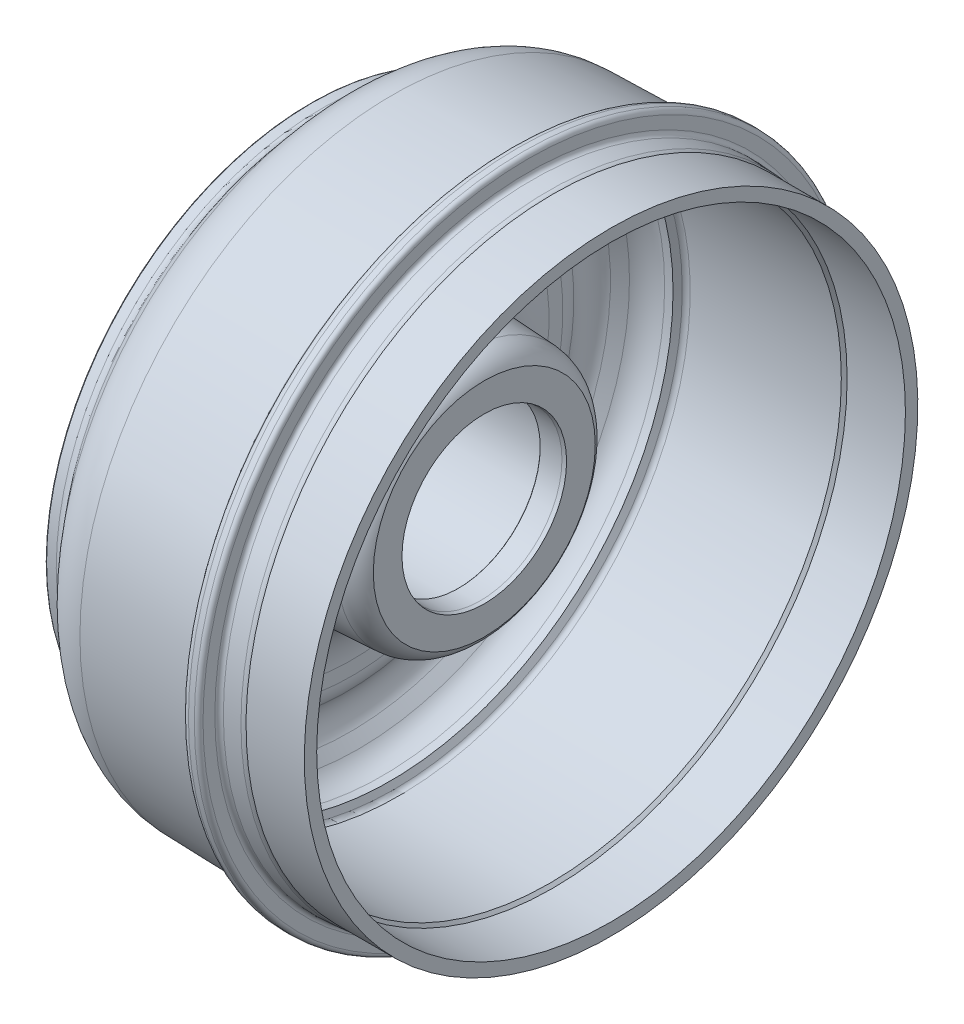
ISO-10303-21;
HEADER;
FILE_DESCRIPTION(('STEP AP214'),'2;1');
FILE_NAME('part.step','',(''),(''),'','','');
FILE_SCHEMA(('AUTOMOTIVE_DESIGN { 1 0 10303 214 1 1 1 1 }'));
ENDSEC;
DATA;
#1=APPLICATION_CONTEXT('core data for automotive mechanical design processes');
#2=APPLICATION_PROTOCOL_DEFINITION('international standard','automotive_design',2000,#1);
#3=PRODUCT_CONTEXT('',#1,'mechanical');
#4=PRODUCT('Part','Part','',(#3));
#5=PRODUCT_RELATED_PRODUCT_CATEGORY('part','',(#4));
#6=PRODUCT_DEFINITION_FORMATION('','',#4);
#7=PRODUCT_DEFINITION_CONTEXT('part definition',#1,'design');
#8=PRODUCT_DEFINITION('design','',#6,#7);
#9=PRODUCT_DEFINITION_SHAPE('','',#8);
#10=(LENGTH_UNIT() NAMED_UNIT(*) SI_UNIT(.MILLI.,.METRE.));
#11=(NAMED_UNIT(*) PLANE_ANGLE_UNIT() SI_UNIT($,.RADIAN.));
#12=(NAMED_UNIT(*) SI_UNIT($,.STERADIAN.) SOLID_ANGLE_UNIT());
#13=UNCERTAINTY_MEASURE_WITH_UNIT(LENGTH_MEASURE(1.E-05),#10,'distance_accuracy_value','');
#14=(GEOMETRIC_REPRESENTATION_CONTEXT(3) GLOBAL_UNCERTAINTY_ASSIGNED_CONTEXT((#13)) GLOBAL_UNIT_ASSIGNED_CONTEXT((#10,
#11,#12)) REPRESENTATION_CONTEXT('',''));
#15=CARTESIAN_POINT('',(0.,0.,0.));
#16=DIRECTION('',(0.,0.,1.));
#17=DIRECTION('',(1.,0.,0.));
#18=AXIS2_PLACEMENT_3D('',#15,#16,#17);
#19=CARTESIAN_POINT('',(-60.,0.,0.));
#20=DIRECTION('',(-1.,0.,0.));
#21=DIRECTION('',(0.,0.,1.));
#22=AXIS2_PLACEMENT_3D('',#19,#20,#21);
#23=CYLINDRICAL_SURFACE('',#22,90.9999999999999);
#24=CARTESIAN_POINT('',(5.13476936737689,0.,0.));
#25=DIRECTION('',(-1.,0.,0.));
#26=DIRECTION('',(0.,0.,1.));
#27=AXIS2_PLACEMENT_3D('',#24,#25,#26);
#28=CIRCLE('',#27,90.9999999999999);
#29=CARTESIAN_POINT('',(5.13476936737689,0.,90.9999999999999));
#30=VERTEX_POINT('',#29);
#31=EDGE_CURVE('E284',#30,#30,#28,.T.);
#32=ORIENTED_EDGE('',*,*,#31,.T.);
#33=EDGE_LOOP('',(#32));
#34=FACE_BOUND('',#33,.T.);
#35=CARTESIAN_POINT('',(1.81467910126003,0.,0.));
#36=DIRECTION('',(1.,0.,0.));
#37=DIRECTION('',(0.,0.,-1.));
#38=AXIS2_PLACEMENT_3D('',#35,#36,#37);
#39=CIRCLE('',#38,90.9999999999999);
#40=CARTESIAN_POINT('',(1.81467910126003,0.,-90.9999999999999));
#41=VERTEX_POINT('',#40);
#42=EDGE_CURVE('E41',#41,#41,#39,.T.);
#43=ORIENTED_EDGE('',*,*,#42,.T.);
#44=EDGE_LOOP('',(#43));
#45=FACE_BOUND('',#44,.T.);
#46=ADVANCED_FACE('F13',(#34,#45),#23,.T.);
#47=CARTESIAN_POINT('',(1.50000000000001,0.,64.6191339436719));
#48=DIRECTION('',(-1.,0.,0.));
#49=DIRECTION('',(0.,0.,1.));
#50=AXIS2_PLACEMENT_3D('',#47,#48,#49);
#51=PLANE('',#50);
#52=CARTESIAN_POINT('',(1.50000000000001,53.2591649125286,17.304951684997));
#53=DIRECTION('',(1.,0.,0.));
#54=DIRECTION('',(0.,0.,-1.));
#55=AXIS2_PLACEMENT_3D('',#52,#53,#54);
#56=CIRCLE('',#55,6.25);
#57=CARTESIAN_POINT('',(1.50000000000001,53.2591649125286,11.054951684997));
#58=VERTEX_POINT('',#57);
#59=EDGE_CURVE('E446',#58,#58,#56,.T.);
#60=ORIENTED_EDGE('',*,*,#59,.T.);
#61=EDGE_LOOP('',(#60));
#62=FACE_BOUND('',#61,.T.);
#63=CARTESIAN_POINT('',(1.50000000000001,32.9159741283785,-45.3049516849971));
#64=DIRECTION('',(1.,0.,0.));
#65=DIRECTION('',(0.,0.,-1.));
#66=AXIS2_PLACEMENT_3D('',#63,#64,#65);
#67=CIRCLE('',#66,6.25);
#68=CARTESIAN_POINT('',(1.50000000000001,32.9159741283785,-51.5549516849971));
#69=VERTEX_POINT('',#68);
#70=EDGE_CURVE('E440',#69,#69,#67,.T.);
#71=ORIENTED_EDGE('',*,*,#70,.T.);
#72=EDGE_LOOP('',(#71));
#73=FACE_BOUND('',#72,.T.);
#74=CARTESIAN_POINT('',(1.50000000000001,-32.9159741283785,-45.3049516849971));
#75=DIRECTION('',(1.,0.,0.));
#76=DIRECTION('',(0.,0.,-1.));
#77=AXIS2_PLACEMENT_3D('',#74,#75,#76);
#78=CIRCLE('',#77,6.25);
#79=CARTESIAN_POINT('',(1.50000000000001,-32.9159741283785,-51.5549516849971));
#80=VERTEX_POINT('',#79);
#81=EDGE_CURVE('E433',#80,#80,#78,.T.);
#82=ORIENTED_EDGE('',*,*,#81,.T.);
#83=EDGE_LOOP('',(#82));
#84=FACE_BOUND('',#83,.T.);
#85=CARTESIAN_POINT('',(1.50000000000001,-53.2591649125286,17.304951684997));
#86=DIRECTION('',(1.,0.,0.));
#87=DIRECTION('',(0.,0.,-1.));
#88=AXIS2_PLACEMENT_3D('',#85,#86,#87);
#89=CIRCLE('',#88,6.25);
#90=CARTESIAN_POINT('',(1.50000000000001,-53.2591649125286,11.054951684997));
#91=VERTEX_POINT('',#90);
#92=EDGE_CURVE('E426',#91,#91,#89,.T.);
#93=ORIENTED_EDGE('',*,*,#92,.T.);
#94=EDGE_LOOP('',(#93));
#95=FACE_BOUND('',#94,.T.);
#96=CARTESIAN_POINT('',(1.50000000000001,0.,56.));
#97=DIRECTION('',(1.,0.,0.));
#98=DIRECTION('',(0.,0.,-1.));
#99=AXIS2_PLACEMENT_3D('',#96,#97,#98);
#100=CIRCLE('',#99,6.25);
#101=CARTESIAN_POINT('',(1.50000000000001,0.,49.75));
#102=VERTEX_POINT('',#101);
#103=EDGE_CURVE('E42',#102,#102,#100,.T.);
#104=ORIENTED_EDGE('',*,*,#103,.T.);
#105=EDGE_LOOP('',(#104));
#106=FACE_BOUND('',#105,.T.);
#107=CARTESIAN_POINT('',(1.50000000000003,0.,0.));
#108=DIRECTION('',(-1.,0.,0.));
#109=DIRECTION('',(0.,0.,1.));
#110=AXIS2_PLACEMENT_3D('',#107,#108,#109);
#111=CIRCLE('',#110,35.5);
#112=CARTESIAN_POINT('',(1.50000000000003,0.,35.5));
#113=VERTEX_POINT('',#112);
#114=EDGE_CURVE('E410',#113,#113,#111,.T.);
#115=ORIENTED_EDGE('',*,*,#114,.F.);
#116=EDGE_LOOP('',(#115));
#117=FACE_BOUND('',#116,.T.);
#118=CARTESIAN_POINT('',(1.50000000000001,0.,0.));
#119=DIRECTION('',(-1.,0.,0.));
#120=DIRECTION('',(0.,0.,1.));
#121=AXIS2_PLACEMENT_3D('',#118,#119,#120);
#122=CIRCLE('',#121,90.7979621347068);
#123=CARTESIAN_POINT('',(1.50000000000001,0.,90.7979621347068));
#124=VERTEX_POINT('',#123);
#125=EDGE_CURVE('E31',#124,#124,#122,.T.);
#126=ORIENTED_EDGE('',*,*,#125,.T.);
#127=EDGE_LOOP('',(#126));
#128=FACE_BOUND('',#127,.T.);
#129=ADVANCED_FACE('F88',(#62,#73,#84,#95,#106,#117,#128),#51,.T.);
#130=CARTESIAN_POINT('',(61.,0.,48.9983269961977));
#131=DIRECTION('',(-1.,0.,0.));
#132=DIRECTION('',(0.,0.,1.));
#133=AXIS2_PLACEMENT_3D('',#130,#131,#132);
#134=PLANE('',#133);
#135=CARTESIAN_POINT('',(61.,0.,0.));
#136=DIRECTION('',(-1.,0.,0.));
#137=DIRECTION('',(0.,0.,1.));
#138=AXIS2_PLACEMENT_3D('',#135,#136,#137);
#139=CIRCLE('',#138,38.0824287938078);
#140=CARTESIAN_POINT('',(61.,0.,38.0824287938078));
#141=VERTEX_POINT('',#140);
#142=EDGE_CURVE('E293',#141,#141,#139,.F.);
#143=ORIENTED_EDGE('',*,*,#142,.T.);
#144=EDGE_LOOP('',(#143));
#145=FACE_BOUND('',#144,.T.);
#146=CARTESIAN_POINT('',(61.,0.,0.));
#147=DIRECTION('',(-1.,0.,0.));
#148=DIRECTION('',(0.,0.,1.));
#149=AXIS2_PLACEMENT_3D('',#146,#147,#148);
#150=CIRCLE('',#149,28.2380414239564);
#151=CARTESIAN_POINT('',(61.,0.,28.2380414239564));
#152=VERTEX_POINT('',#151);
#153=EDGE_CURVE('E413',#152,#152,#150,.F.);
#154=ORIENTED_EDGE('',*,*,#153,.F.);
#155=EDGE_LOOP('',(#154));
#156=FACE_BOUND('',#155,.T.);
#157=ADVANCED_FACE('F91',(#145,#156),#134,.F.);
#158=CARTESIAN_POINT('',(-60.,0.,0.));
#159=DIRECTION('',(-1.,0.,0.));
#160=DIRECTION('',(0.,0.,1.));
#161=AXIS2_PLACEMENT_3D('',#158,#159,#160);
#162=CYLINDRICAL_SURFACE('',#161,28.);
#163=CARTESIAN_POINT('',(52.2,0.,0.));
#164=DIRECTION('',(1.,0.,0.));
#165=DIRECTION('',(0.,0.,-1.));
#166=AXIS2_PLACEMENT_3D('',#163,#164,#165);
#167=CIRCLE('',#166,28.);
#168=CARTESIAN_POINT('',(52.2,0.,-28.));
#169=VERTEX_POINT('',#168);
#170=EDGE_CURVE('E308',#169,#169,#167,.F.);
#171=ORIENTED_EDGE('',*,*,#170,.T.);
#172=EDGE_LOOP('',(#171));
#173=FACE_BOUND('',#172,.T.);
#174=CARTESIAN_POINT('',(59.65,0.,0.));
#175=DIRECTION('',(1.,0.,0.));
#176=DIRECTION('',(0.,0.,-1.));
#177=AXIS2_PLACEMENT_3D('',#174,#175,#176);
#178=CIRCLE('',#177,28.);
#179=CARTESIAN_POINT('',(59.65,0.,-28.));
#180=VERTEX_POINT('',#179);
#181=EDGE_CURVE('E416',#180,#180,#178,.T.);
#182=ORIENTED_EDGE('',*,*,#181,.T.);
#183=EDGE_LOOP('',(#182));
#184=FACE_BOUND('',#183,.T.);
#185=ADVANCED_FACE('F133',(#173,#184),#162,.F.);
#186=CARTESIAN_POINT('',(11.,0.,32.));
#187=DIRECTION('',(-1.,0.,0.));
#188=DIRECTION('',(0.,0.,1.));
#189=AXIS2_PLACEMENT_3D('',#186,#187,#188);
#190=PLANE('',#189);
#191=CARTESIAN_POINT('',(11.,0.,0.));
#192=DIRECTION('',(-1.,0.,0.));
#193=DIRECTION('',(0.,0.,1.));
#194=AXIS2_PLACEMENT_3D('',#191,#192,#193);
#195=CIRCLE('',#194,33.3318813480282);
#196=CARTESIAN_POINT('',(11.,0.,33.3318813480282));
#197=VERTEX_POINT('',#196);
#198=EDGE_CURVE('E383',#197,#197,#195,.T.);
#199=ORIENTED_EDGE('',*,*,#198,.F.);
#200=EDGE_LOOP('',(#199));
#201=FACE_BOUND('',#200,.T.);
#202=CARTESIAN_POINT('',(11.,0.,0.));
#203=DIRECTION('',(-1.,0.,0.));
#204=DIRECTION('',(0.,0.,1.));
#205=AXIS2_PLACEMENT_3D('',#202,#203,#204);
#206=CIRCLE('',#205,32.05);
#207=CARTESIAN_POINT('',(11.,0.,32.05));
#208=VERTEX_POINT('',#207);
#209=EDGE_CURVE('E299',#208,#208,#206,.F.);
#210=ORIENTED_EDGE('',*,*,#209,.F.);
#211=EDGE_LOOP('',(#210));
#212=FACE_BOUND('',#211,.T.);
#213=ADVANCED_FACE('F129',(#201,#212),#190,.F.);
#214=CARTESIAN_POINT('',(-60.,0.,0.));
#215=DIRECTION('',(-1.,0.,0.));
#216=DIRECTION('',(0.,0.,1.));
#217=AXIS2_PLACEMENT_3D('',#214,#215,#216);
#218=CYLINDRICAL_SURFACE('',#217,32.);
#219=CARTESIAN_POINT('',(15.15,0.,0.));
#220=DIRECTION('',(1.,0.,0.));
#221=DIRECTION('',(0.,0.,-1.));
#222=AXIS2_PLACEMENT_3D('',#219,#220,#221);
#223=CIRCLE('',#222,32.);
#224=CARTESIAN_POINT('',(15.15,0.,-32.));
#225=VERTEX_POINT('',#224);
#226=EDGE_CURVE('E296',#225,#225,#223,.F.);
#227=ORIENTED_EDGE('',*,*,#226,.T.);
#228=EDGE_LOOP('',(#227));
#229=FACE_BOUND('',#228,.T.);
#230=CARTESIAN_POINT('',(50.,0.,0.));
#231=DIRECTION('',(-1.,0.,0.));
#232=DIRECTION('',(0.,0.,1.));
#233=AXIS2_PLACEMENT_3D('',#230,#231,#232);
#234=CIRCLE('',#233,32.);
#235=CARTESIAN_POINT('',(50.,0.,32.));
#236=VERTEX_POINT('',#235);
#237=EDGE_CURVE('E364',#236,#236,#234,.T.);
#238=ORIENTED_EDGE('',*,*,#237,.F.);
#239=EDGE_LOOP('',(#238));
#240=FACE_BOUND('',#239,.T.);
#241=ADVANCED_FACE('F132',(#229,#240),#218,.F.);
#242=CARTESIAN_POINT('',(86.,0.,0.));
#243=DIRECTION('',(1.,0.,0.));
#244=DIRECTION('',(0.,0.,-1.));
#245=AXIS2_PLACEMENT_3D('',#242,#243,#244);
#246=CONICAL_SURFACE('',#245,98.5000000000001,0.0261799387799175);
#247=CARTESIAN_POINT('',(25.9563848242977,0.,0.));
#248=DIRECTION('',(-1.,0.,0.));
#249=DIRECTION('',(0.,0.,1.));
#250=AXIS2_PLACEMENT_3D('',#247,#248,#249);
#251=CIRCLE('',#250,96.9277026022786);
#252=CARTESIAN_POINT('',(25.9563848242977,0.,96.9277026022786));
#253=VERTEX_POINT('',#252);
#254=EDGE_CURVE('E254',#253,#253,#251,.T.);
#255=ORIENTED_EDGE('',*,*,#254,.T.);
#256=EDGE_LOOP('',(#255));
#257=FACE_BOUND('',#256,.T.);
#258=CARTESIAN_POINT('',(28.7687265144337,0.,0.));
#259=DIRECTION('',(1.,0.,0.));
#260=DIRECTION('',(0.,0.,-1.));
#261=AXIS2_PLACEMENT_3D('',#258,#259,#260);
#262=CIRCLE('',#261,97.0013463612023);
#263=CARTESIAN_POINT('',(28.7687265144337,0.,-97.0013463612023));
#264=VERTEX_POINT('',#263);
#265=EDGE_CURVE('E290',#264,#264,#262,.T.);
#266=ORIENTED_EDGE('',*,*,#265,.T.);
#267=EDGE_LOOP('',(#266));
#268=FACE_BOUND('',#267,.T.);
#269=ADVANCED_FACE('F165',(#257,#268),#246,.F.);
#270=CARTESIAN_POINT('',(82.9999999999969,0.,0.));
#271=DIRECTION('',(1.,0.,0.));
#272=DIRECTION('',(0.,0.,-1.));
#273=AXIS2_PLACEMENT_3D('',#270,#271,#272);
#274=TOROIDAL_SURFACE('',#273,102.653106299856,3.);
#275=CARTESIAN_POINT('',(83.1570078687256,0.,0.));
#276=DIRECTION('',(1.,0.,0.));
#277=DIRECTION('',(0.,0.,-1.));
#278=AXIS2_PLACEMENT_3D('',#275,#276,#277);
#279=CIRCLE('',#278,105.648994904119);
#280=CARTESIAN_POINT('',(83.1570078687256,0.,-105.648994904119));
#281=VERTEX_POINT('',#280);
#282=EDGE_CURVE('E260',#281,#281,#279,.F.);
#283=ORIENTED_EDGE('',*,*,#282,.F.);
#284=EDGE_LOOP('',(#283));
#285=FACE_BOUND('',#284,.T.);
#286=CARTESIAN_POINT('',(84.5,0.,0.));
#287=DIRECTION('',(-1.,0.,0.));
#288=DIRECTION('',(0.,1.,0.));
#289=AXIS2_PLACEMENT_3D('',#286,#287,#288);
#290=CIRCLE('',#289,105.251182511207);
#291=CARTESIAN_POINT('',(84.5,105.251182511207,0.));
#292=VERTEX_POINT('',#291);
#293=EDGE_CURVE('E453',#292,#292,#290,.T.);
#294=ORIENTED_EDGE('',*,*,#293,.T.);
#295=EDGE_LOOP('',(#294));
#296=FACE_BOUND('',#295,.T.);
#297=ADVANCED_FACE('F204',(#285,#296),#274,.T.);
#298=CARTESIAN_POINT('',(29.9307048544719,0.,0.));
#299=DIRECTION('',(-1.,0.,0.));
#300=DIRECTION('',(0.,0.,1.));
#301=AXIS2_PLACEMENT_3D('',#298,#299,#300);
#302=TOROIDAL_SURFACE('',#301,87.2132733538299,20.);
#303=CARTESIAN_POINT('',(29.4709477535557,0.,0.));
#304=DIRECTION('',(-1.,0.,0.));
#305=DIRECTION('',(0.,0.,1.));
#306=AXIS2_PLACEMENT_3D('',#303,#304,#305);
#307=CIRCLE('',#306,107.207988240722);
#308=CARTESIAN_POINT('',(29.4709477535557,0.,107.207988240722));
#309=VERTEX_POINT('',#308);
#310=EDGE_CURVE('E257',#309,#309,#307,.T.);
#311=ORIENTED_EDGE('',*,*,#310,.T.);
#312=EDGE_LOOP('',(#311));
#313=FACE_BOUND('',#312,.T.);
#314=CARTESIAN_POINT('',(14.6098159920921,0.,0.));
#315=DIRECTION('',(-1.,0.,0.));
#316=DIRECTION('',(0.,0.,1.));
#317=AXIS2_PLACEMENT_3D('',#314,#315,#316);
#318=CIRCLE('',#317,100.06902554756);
#319=CARTESIAN_POINT('',(14.6098159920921,0.,100.06902554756));
#320=VERTEX_POINT('',#319);
#321=EDGE_CURVE('E239',#320,#320,#318,.T.);
#322=ORIENTED_EDGE('',*,*,#321,.F.);
#323=EDGE_LOOP('',(#322));
#324=FACE_BOUND('',#323,.T.);
#325=ADVANCED_FACE('F15',(#313,#324),#302,.T.);
#326=CARTESIAN_POINT('',(29.4709477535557,0.,0.));
#327=DIRECTION('',(1.,0.,0.));
#328=DIRECTION('',(0.,0.,-1.));
#329=AXIS2_PLACEMENT_3D('',#326,#327,#328);
#330=CONICAL_SURFACE('',#329,107.207988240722,0.0229898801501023);
#331=CARTESIAN_POINT('',(67.5574696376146,0.,0.));
#332=DIRECTION('',(1.,0.,0.));
#333=DIRECTION('',(0.,0.,-1.));
#334=AXIS2_PLACEMENT_3D('',#331,#332,#333);
#335=CIRCLE('',#334,108.083747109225);
#336=CARTESIAN_POINT('',(67.5574696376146,0.,-108.083747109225));
#337=VERTEX_POINT('',#336);
#338=EDGE_CURVE('E263',#337,#337,#335,.F.);
#339=ORIENTED_EDGE('',*,*,#338,.T.);
#340=EDGE_LOOP('',(#339));
#341=FACE_BOUND('',#340,.T.);
#342=ORIENTED_EDGE('',*,*,#310,.F.);
#343=EDGE_LOOP('',(#342));
#344=FACE_BOUND('',#343,.T.);
#345=ADVANCED_FACE('F349',(#341,#344),#330,.T.);
#346=CARTESIAN_POINT('',(-60.,0.,0.));
#347=DIRECTION('',(-1.,0.,0.));
#348=DIRECTION('',(0.,0.,1.));
#349=AXIS2_PLACEMENT_3D('',#346,#347,#348);
#350=CYLINDRICAL_SURFACE('',#349,113.);
#351=CARTESIAN_POINT('',(74.5,0.,0.));
#352=DIRECTION('',(1.,0.,0.));
#353=DIRECTION('',(0.,0.,-1.));
#354=AXIS2_PLACEMENT_3D('',#351,#352,#353);
#355=CIRCLE('',#354,113.);
#356=CARTESIAN_POINT('',(74.5,0.,-113.));
#357=VERTEX_POINT('',#356);
#358=EDGE_CURVE('E278',#357,#357,#355,.F.);
#359=ORIENTED_EDGE('',*,*,#358,.T.);
#360=EDGE_LOOP('',(#359));
#361=FACE_BOUND('',#360,.T.);
#362=CARTESIAN_POINT('',(72.4993096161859,0.,0.));
#363=DIRECTION('',(1.,0.,0.));
#364=DIRECTION('',(0.,0.,-1.));
#365=AXIS2_PLACEMENT_3D('',#362,#363,#364);
#366=CIRCLE('',#365,113.);
#367=CARTESIAN_POINT('',(72.4993096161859,0.,-113.));
#368=VERTEX_POINT('',#367);
#369=EDGE_CURVE('E269',#368,#368,#366,.T.);
#370=ORIENTED_EDGE('',*,*,#369,.T.);
#371=EDGE_LOOP('',(#370));
#372=FACE_BOUND('',#371,.T.);
#373=ADVANCED_FACE('F346',(#361,#372),#350,.T.);
#374=CARTESIAN_POINT('',(76.,0.,113.));
#375=DIRECTION('',(1.,0.,0.));
#376=DIRECTION('',(0.,0.,-1.));
#377=AXIS2_PLACEMENT_3D('',#374,#375,#376);
#378=PLANE('',#377);
#379=CARTESIAN_POINT('',(76.,0.,0.));
#380=DIRECTION('',(1.,0.,0.));
#381=DIRECTION('',(0.,0.,-1.));
#382=AXIS2_PLACEMENT_3D('',#379,#380,#381);
#383=CIRCLE('',#382,111.5);
#384=CARTESIAN_POINT('',(76.,0.,-111.5));
#385=VERTEX_POINT('',#384);
#386=EDGE_CURVE('E281',#385,#385,#383,.T.);
#387=ORIENTED_EDGE('',*,*,#386,.T.);
#388=EDGE_LOOP('',(#387));
#389=FACE_BOUND('',#388,.T.);
#390=CARTESIAN_POINT('',(76.,0.,0.));
#391=DIRECTION('',(1.,0.,0.));
#392=DIRECTION('',(0.,0.,-1.));
#393=AXIS2_PLACEMENT_3D('',#390,#391,#392);
#394=CIRCLE('',#393,107.447524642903);
#395=CARTESIAN_POINT('',(76.,0.,-107.447524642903));
#396=VERTEX_POINT('',#395);
#397=EDGE_CURVE('E272',#396,#396,#394,.F.);
#398=ORIENTED_EDGE('',*,*,#397,.T.);
#399=EDGE_LOOP('',(#398));
#400=FACE_BOUND('',#399,.T.);
#401=ADVANCED_FACE('F342',(#389,#400),#378,.T.);
#402=CARTESIAN_POINT('',(76.,0.,0.));
#403=DIRECTION('',(-1.,0.,0.));
#404=DIRECTION('',(0.,0.,1.));
#405=AXIS2_PLACEMENT_3D('',#402,#403,#404);
#406=CONICAL_SURFACE('',#405,106.02407779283,0.0523598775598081);
#407=CARTESIAN_POINT('',(77.4214960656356,0.,0.));
#408=DIRECTION('',(-1.,0.,0.));
#409=DIRECTION('',(0.,0.,1.));
#410=AXIS2_PLACEMENT_3D('',#407,#408,#409);
#411=CIRCLE('',#410,105.949580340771);
#412=CARTESIAN_POINT('',(77.4214960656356,0.,105.949580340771));
#413=VERTEX_POINT('',#412);
#414=EDGE_CURVE('E275',#413,#413,#411,.F.);
#415=ORIENTED_EDGE('',*,*,#414,.T.);
#416=EDGE_LOOP('',(#415));
#417=FACE_BOUND('',#416,.T.);
#418=ORIENTED_EDGE('',*,*,#282,.T.);
#419=EDGE_LOOP('',(#418));
#420=FACE_BOUND('',#419,.T.);
#421=ADVANCED_FACE('F339',(#417,#420),#406,.T.);
#422=CARTESIAN_POINT('',(26.2443312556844,0.,0.));
#423=DIRECTION('',(-1.,0.,0.));
#424=DIRECTION('',(0.,0.,1.));
#425=AXIS2_PLACEMENT_3D('',#422,#423,#424);
#426=TOROIDAL_SURFACE('',#425,85.9314720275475,11.);
#427=CARTESIAN_POINT('',(17.8178423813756,0.,0.));
#428=DIRECTION('',(-1.,0.,0.));
#429=DIRECTION('',(0.,0.,1.));
#430=AXIS2_PLACEMENT_3D('',#427,#428,#429);
#431=CIRCLE('',#430,93.0021357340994);
#432=CARTESIAN_POINT('',(17.8178423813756,0.,93.0021357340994));
#433=VERTEX_POINT('',#432);
#434=EDGE_CURVE('E251',#433,#433,#431,.T.);
#435=ORIENTED_EDGE('',*,*,#434,.T.);
#436=EDGE_LOOP('',(#435));
#437=FACE_BOUND('',#436,.T.);
#438=ORIENTED_EDGE('',*,*,#254,.F.);
#439=EDGE_LOOP('',(#438));
#440=FACE_BOUND('',#439,.T.);
#441=ADVANCED_FACE('F337',(#437,#440),#426,.F.);
#442=CARTESIAN_POINT('',(17.8178423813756,0.,0.));
#443=DIRECTION('',(1.,0.,0.));
#444=DIRECTION('',(0.,0.,-1.));
#445=AXIS2_PLACEMENT_3D('',#442,#443,#444);
#446=CONICAL_SURFACE('',#445,93.0021357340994,0.872664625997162);
#447=CARTESIAN_POINT('',(14.8395555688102,0.,0.));
#448=DIRECTION('',(-1.,0.,0.));
#449=DIRECTION('',(0.,0.,1.));
#450=AXIS2_PLACEMENT_3D('',#447,#448,#449);
#451=CIRCLE('',#450,89.4527517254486);
#452=CARTESIAN_POINT('',(14.8395555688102,0.,89.4527517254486));
#453=VERTEX_POINT('',#452);
#454=EDGE_CURVE('E248',#453,#453,#451,.T.);
#455=ORIENTED_EDGE('',*,*,#454,.T.);
#456=EDGE_LOOP('',(#455));
#457=FACE_BOUND('',#456,.T.);
#458=ORIENTED_EDGE('',*,*,#434,.F.);
#459=EDGE_LOOP('',(#458));
#460=FACE_BOUND('',#459,.T.);
#461=ADVANCED_FACE('F540',(#457,#460),#446,.F.);
#462=CARTESIAN_POINT('',(22.5,0.,0.));
#463=DIRECTION('',(-1.,0.,0.));
#464=DIRECTION('',(0.,0.,1.));
#465=AXIS2_PLACEMENT_3D('',#462,#463,#464);
#466=TOROIDAL_SURFACE('',#465,83.0248756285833,9.99999999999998);
#467=CARTESIAN_POINT('',(14.,0.,0.));
#468=DIRECTION('',(-1.,0.,0.));
#469=DIRECTION('',(0.,0.,1.));
#470=AXIS2_PLACEMENT_3D('',#467,#468,#469);
#471=CIRCLE('',#470,77.7570487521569);
#472=CARTESIAN_POINT('',(14.,0.,77.7570487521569));
#473=VERTEX_POINT('',#472);
#474=EDGE_CURVE('E245',#473,#473,#471,.T.);
#475=ORIENTED_EDGE('',*,*,#474,.T.);
#476=EDGE_LOOP('',(#475));
#477=FACE_BOUND('',#476,.T.);
#478=ORIENTED_EDGE('',*,*,#454,.F.);
#479=EDGE_LOOP('',(#478));
#480=FACE_BOUND('',#479,.T.);
#481=ADVANCED_FACE('F534',(#477,#480),#466,.F.);
#482=CARTESIAN_POINT('',(5.50000000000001,0.,0.));
#483=DIRECTION('',(-1.,0.,0.));
#484=DIRECTION('',(0.,0.,1.));
#485=AXIS2_PLACEMENT_3D('',#482,#483,#484);
#486=TOROIDAL_SURFACE('',#485,72.4892218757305,9.99999999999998);
#487=CARTESIAN_POINT('',(15.5,0.,0.));
#488=DIRECTION('',(-1.,0.,0.));
#489=DIRECTION('',(0.,0.,1.));
#490=AXIS2_PLACEMENT_3D('',#487,#488,#489);
#491=CIRCLE('',#490,72.4892218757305);
#492=CARTESIAN_POINT('',(15.5,0.,72.4892218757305));
#493=VERTEX_POINT('',#492);
#494=EDGE_CURVE('E237',#493,#493,#491,.T.);
#495=ORIENTED_EDGE('',*,*,#494,.T.);
#496=EDGE_LOOP('',(#495));
#497=FACE_BOUND('',#496,.T.);
#498=ORIENTED_EDGE('',*,*,#474,.F.);
#499=EDGE_LOOP('',(#498));
#500=FACE_BOUND('',#499,.T.);
#501=ADVANCED_FACE('F529',(#497,#500),#486,.T.);
#502=CARTESIAN_POINT('',(15.5,0.,72.4892218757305));
#503=DIRECTION('',(1.,0.,0.));
#504=DIRECTION('',(0.,0.,-1.));
#505=AXIS2_PLACEMENT_3D('',#502,#503,#504);
#506=PLANE('',#505);
#507=CARTESIAN_POINT('',(15.5,0.,0.));
#508=DIRECTION('',(-1.,0.,0.));
#509=DIRECTION('',(0.,0.,1.));
#510=AXIS2_PLACEMENT_3D('',#507,#508,#509);
#511=CIRCLE('',#510,67.7121114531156);
#512=CARTESIAN_POINT('',(15.5,0.,67.7121114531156));
#513=VERTEX_POINT('',#512);
#514=EDGE_CURVE('E234',#513,#513,#511,.T.);
#515=ORIENTED_EDGE('',*,*,#514,.T.);
#516=EDGE_LOOP('',(#515));
#517=FACE_BOUND('',#516,.T.);
#518=ORIENTED_EDGE('',*,*,#494,.F.);
#519=EDGE_LOOP('',(#518));
#520=FACE_BOUND('',#519,.T.);
#521=ADVANCED_FACE('F224',(#517,#520),#506,.T.);
#522=CARTESIAN_POINT('',(39.5,0.,0.));
#523=DIRECTION('',(-1.,0.,0.));
#524=DIRECTION('',(0.,0.,1.));
#525=AXIS2_PLACEMENT_3D('',#522,#523,#524);
#526=TOROIDAL_SURFACE('',#525,67.7121114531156,24.);
#527=CARTESIAN_POINT('',(22.3174705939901,48.8736119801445,14.4188772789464));
#528=CARTESIAN_POINT('',(22.2760740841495,48.9538408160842,14.2969604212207));
#529=CARTESIAN_POINT('',(22.229192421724,49.0382732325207,14.1797432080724));
#530=CARTESIAN_POINT('',(22.1262377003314,49.2142926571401,13.9550426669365));
#531=CARTESIAN_POINT('',(22.0701588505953,49.3058841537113,13.8475655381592));
#532=CARTESIAN_POINT('',(21.9503630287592,49.4953521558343,13.6421926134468));
#533=CARTESIAN_POINT('',(21.8866216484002,49.593248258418,13.5443293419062));
#534=CARTESIAN_POINT('',(21.7531949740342,49.7941394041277,13.3584562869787));
#535=CARTESIAN_POINT('',(21.6835100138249,49.8971341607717,13.2704459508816));
#536=CARTESIAN_POINT('',(21.5213874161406,50.1340001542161,13.0831001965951));
#537=CARTESIAN_POINT('',(21.427635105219,50.2691223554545,12.9864830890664));
#538=CARTESIAN_POINT('',(21.2349921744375,50.5452221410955,12.8078345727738));
#539=CARTESIAN_POINT('',(21.1361000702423,50.6862014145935,12.7258074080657));
#540=CARTESIAN_POINT('',(20.9349342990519,50.9731425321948,12.5760211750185));
#541=CARTESIAN_POINT('',(20.8326615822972,51.119102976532,12.5082581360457));
#542=CARTESIAN_POINT('',(20.6261255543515,51.415354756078,12.3867719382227));
#543=CARTESIAN_POINT('',(20.5218624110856,51.5656457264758,12.3330476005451));
#544=CARTESIAN_POINT('',(20.3108151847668,51.8724320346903,12.2388253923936));
#545=CARTESIAN_POINT('',(20.2040176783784,52.0289885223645,12.1985568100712));
#546=CARTESIAN_POINT('',(19.9906100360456,52.3453611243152,12.1325650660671));
#547=CARTESIAN_POINT('',(19.8839999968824,52.5051785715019,12.106847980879));
#548=CARTESIAN_POINT('',(19.6719544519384,52.8273159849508,12.0702324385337));
#549=CARTESIAN_POINT('',(19.5665191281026,52.9896363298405,12.0593362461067));
#550=CARTESIAN_POINT('',(19.357767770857,53.3158471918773,12.0527246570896));
#551=CARTESIAN_POINT('',(19.2544508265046,53.479736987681,12.0570025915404));
#552=CARTESIAN_POINT('',(19.0424688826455,53.8214619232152,12.0821179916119));
#553=CARTESIAN_POINT('',(18.934046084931,53.9993540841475,12.1042652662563));
#554=CARTESIAN_POINT('',(18.721543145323,54.3544525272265,12.1673101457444));
#555=CARTESIAN_POINT('',(18.6174633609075,54.531658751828,12.2082092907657));
#556=CARTESIAN_POINT('',(18.4146114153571,54.8835334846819,12.3092123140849));
#557=CARTESIAN_POINT('',(18.3158368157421,55.0582031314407,12.3693072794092));
#558=CARTESIAN_POINT('',(18.1243905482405,55.4030220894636,12.5090198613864));
#559=CARTESIAN_POINT('',(18.0317177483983,55.5731722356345,12.5886338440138));
#560=CARTESIAN_POINT('',(17.8634502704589,55.8874994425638,12.7571599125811));
#561=CARTESIAN_POINT('',(17.7871161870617,56.0324163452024,12.8439564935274));
#562=CARTESIAN_POINT('',(17.6402241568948,56.3151494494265,13.0326766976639));
#563=CARTESIAN_POINT('',(17.5696652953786,56.4529667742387,13.1345979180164));
#564=CARTESIAN_POINT('',(17.434700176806,56.7195779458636,13.3530259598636));
#565=CARTESIAN_POINT('',(17.3702890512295,56.8483789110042,13.4695210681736));
#566=CARTESIAN_POINT('',(17.2477826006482,57.095216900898,13.7164059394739));
#567=CARTESIAN_POINT('',(17.1896863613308,57.2132554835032,13.8467936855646));
#568=CARTESIAN_POINT('',(17.0873464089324,57.421636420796,14.1018794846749));
#569=CARTESIAN_POINT('',(17.0422919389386,57.5135653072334,14.224960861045));
#570=CARTESIAN_POINT('',(16.9569861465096,57.6869305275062,14.4798605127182));
#571=CARTESIAN_POINT('',(16.9167342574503,57.7683680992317,14.6116777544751));
#572=CARTESIAN_POINT('',(16.8409926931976,57.9197240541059,14.8830072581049));
#573=CARTESIAN_POINT('',(16.8055014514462,57.9896462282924,15.022516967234));
#574=CARTESIAN_POINT('',(16.7391680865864,58.1171168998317,15.3081403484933));
#575=CARTESIAN_POINT('',(16.7083257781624,58.174665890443,15.454253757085));
#576=CARTESIAN_POINT('',(16.653297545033,58.2728287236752,15.7407083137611));
#577=CARTESIAN_POINT('',(16.628786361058,58.3143870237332,15.8806643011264));
#578=CARTESIAN_POINT('',(16.5835023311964,58.3858112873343,16.1641749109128));
#579=CARTESIAN_POINT('',(16.5627307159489,58.4156734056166,16.3077307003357));
#580=CARTESIAN_POINT('',(16.524821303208,58.4633109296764,16.5972274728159));
#581=CARTESIAN_POINT('',(16.5076816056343,58.4810926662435,16.7431671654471));
#582=CARTESIAN_POINT('',(16.4768949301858,58.5043579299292,17.0364454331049));
#583=CARTESIAN_POINT('',(16.463249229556,58.5098369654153,17.1837844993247));
#584=CARTESIAN_POINT('',(16.439666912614,58.5083809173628,17.474760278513));
#585=CARTESIAN_POINT('',(16.4296415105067,58.5017712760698,17.6183915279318));
#586=CARTESIAN_POINT('',(16.4127184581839,58.4767588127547,17.9048630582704));
#587=CARTESIAN_POINT('',(16.4058219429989,58.4583517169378,18.0477030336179));
#588=CARTESIAN_POINT('',(16.3951033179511,58.4098471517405,18.3314405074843));
#589=CARTESIAN_POINT('',(16.3912799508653,58.3797544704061,18.472338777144));
#590=CARTESIAN_POINT('',(16.3866668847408,58.3080627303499,18.751283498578));
#591=CARTESIAN_POINT('',(16.3858783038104,58.2664594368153,18.8893288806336));
#592=CARTESIAN_POINT('',(16.387325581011,58.1723705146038,19.1605858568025));
#593=CARTESIAN_POINT('',(16.3895408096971,58.119961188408,19.2938240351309));
#594=CARTESIAN_POINT('',(16.3969810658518,58.0044526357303,19.5555545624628));
#595=CARTESIAN_POINT('',(16.4022071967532,57.9413494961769,19.6840451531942));
#596=CARTESIAN_POINT('',(16.4157143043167,57.8049676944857,19.9352742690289));
#597=CARTESIAN_POINT('',(16.4239940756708,57.7316930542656,20.0580150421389));
#598=CARTESIAN_POINT('',(16.4436821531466,57.5754853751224,20.2969853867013));
#599=CARTESIAN_POINT('',(16.4550916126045,57.4925487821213,20.413212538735));
#600=CARTESIAN_POINT('',(16.4811262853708,57.3177003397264,20.6382802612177));
#601=CARTESIAN_POINT('',(16.4957505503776,57.2257911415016,20.7471229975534));
#602=CARTESIAN_POINT('',(16.5283188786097,57.0337096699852,20.9567406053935));
#603=CARTESIAN_POINT('',(16.5462641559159,56.9335343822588,21.0575125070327));
#604=CARTESIAN_POINT('',(16.6052463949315,56.6218504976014,21.3465995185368));
#605=CARTESIAN_POINT('',(16.6514575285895,56.3989906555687,21.52193351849));
#606=CARTESIAN_POINT('',(16.7588328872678,55.9290907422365,21.8342142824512));
#607=CARTESIAN_POINT('',(16.8200933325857,55.681901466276,21.970901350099));
#608=CARTESIAN_POINT('',(16.9580744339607,55.1724963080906,22.2018736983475));
#609=CARTESIAN_POINT('',(17.0347956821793,54.9102798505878,22.2961573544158));
#610=CARTESIAN_POINT('',(17.2058883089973,54.3726477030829,22.4432595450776));
#611=CARTESIAN_POINT('',(17.300640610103,54.0970662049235,22.4950236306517));
#612=CARTESIAN_POINT('',(17.5059843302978,53.5471126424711,22.5543463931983));
#613=CARTESIAN_POINT('',(17.6165791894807,53.2727408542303,22.5618954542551));
#614=CARTESIAN_POINT('',(17.8595029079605,52.7161341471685,22.5346635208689));
#615=CARTESIAN_POINT('',(17.992741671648,52.4344271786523,22.497294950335));
#616=CARTESIAN_POINT('',(18.2734135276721,51.8874199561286,22.3802987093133));
#617=CARTESIAN_POINT('',(18.4208516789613,51.6221256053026,22.3006559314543));
#618=CARTESIAN_POINT('',(18.7437114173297,51.0854200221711,22.0933570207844));
#619=CARTESIAN_POINT('',(18.9204351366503,50.816447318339,21.9614415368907));
#620=CARTESIAN_POINT('',(19.2837664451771,50.3091660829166,21.6578241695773));
#621=CARTESIAN_POINT('',(19.4703810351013,50.0708796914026,21.4860938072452));
#622=CARTESIAN_POINT('',(19.7666986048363,49.7239816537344,21.1898333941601));
#623=CARTESIAN_POINT('',(19.8748127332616,49.6038095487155,21.0769473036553));
#624=CARTESIAN_POINT('',(20.0916382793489,49.3748457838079,20.8407128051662));
#625=CARTESIAN_POINT('',(20.2003495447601,49.2660513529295,20.7173669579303));
#626=CARTESIAN_POINT('',(20.417359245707,49.0602481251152,20.4606897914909));
#627=CARTESIAN_POINT('',(20.5256573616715,48.9632471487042,20.3273519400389));
#628=CARTESIAN_POINT('',(20.7405117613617,48.7816630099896,20.0511827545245));
#629=CARTESIAN_POINT('',(20.8470683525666,48.6970776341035,19.9083531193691));
#630=CARTESIAN_POINT('',(21.0407212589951,48.5530855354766,19.6363002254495));
#631=CARTESIAN_POINT('',(21.1282757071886,48.4918081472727,19.5083953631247));
#632=CARTESIAN_POINT('',(21.2999910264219,48.3791471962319,19.246163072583));
#633=CARTESIAN_POINT('',(21.3841517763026,48.3277639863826,19.111835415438));
#634=CARTESIAN_POINT('',(21.6294729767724,48.1895628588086,18.6997582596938));
#635=CARTESIAN_POINT('',(21.7839370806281,48.1183505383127,18.4122778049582));
#636=CARTESIAN_POINT('',(22.0218507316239,48.0383406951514,17.8987409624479));
#637=CARTESIAN_POINT('',(22.1130497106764,48.0176149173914,17.678181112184));
#638=CARTESIAN_POINT('',(22.2324450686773,48.0080784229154,17.3406469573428));
#639=CARTESIAN_POINT('',(22.2693453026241,48.0084925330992,17.2270103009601));
#640=CARTESIAN_POINT('',(22.3364639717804,48.0168911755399,16.9980790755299));
#641=CARTESIAN_POINT('',(22.3666855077,48.0248721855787,16.8827853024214));
#642=CARTESIAN_POINT('',(22.4199086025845,48.0488566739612,16.6499400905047));
#643=CARTESIAN_POINT('',(22.4428232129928,48.0649512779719,16.5323779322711));
#644=CARTESIAN_POINT('',(22.4801921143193,48.1053914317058,16.2973112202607));
#645=CARTESIAN_POINT('',(22.4946464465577,48.1297369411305,16.1798066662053));
#646=CARTESIAN_POINT('',(22.514547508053,48.1866346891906,15.9461383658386));
#647=CARTESIAN_POINT('',(22.5200033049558,48.2191786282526,15.829973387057));
#648=CARTESIAN_POINT('',(22.5217331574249,48.2922059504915,15.6001427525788));
#649=CARTESIAN_POINT('',(22.5180090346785,48.3326877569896,15.4864766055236));
#650=CARTESIAN_POINT('',(22.4972202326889,48.4440381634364,15.2048856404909));
#651=CARTESIAN_POINT('',(22.4742554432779,48.5197982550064,15.0392805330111));
#652=CARTESIAN_POINT('',(22.4093464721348,48.6862024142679,14.7197955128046));
#653=CARTESIAN_POINT('',(22.367397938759,48.7768498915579,14.5659182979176));
#654=CARTESIAN_POINT('',(22.3174705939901,48.8736119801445,14.4188772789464));
#655=B_SPLINE_CURVE_WITH_KNOTS('',3,(#527,#528,#529,#530,#531,#532,#533,#534,#535,#536,#537,
#538,#539,#540,#541,#542,#543,#544,#545,#546,#547,#548,#549,#550,#551,#552,#553,#554,#555,#556,
#557,#558,#559,#560,#561,#562,#563,#564,#565,#566,#567,#568,#569,#570,#571,#572,#573,#574,#575,
#576,#577,#578,#579,#580,#581,#582,#583,#584,#585,#586,#587,#588,#589,#590,#591,#592,#593,#594,
#595,#596,#597,#598,#599,#600,#601,#602,#603,#604,#605,#606,#607,#608,#609,#610,#611,#612,#613,
#614,#615,#616,#617,#618,#619,#620,#621,#622,#623,#624,#625,#626,#627,#628,#629,#630,#631,#632,
#633,#634,#635,#636,#637,#638,#639,#640,#641,#642,#643,#644,#645,#646,#647,#648,#649,#650,#651,
#652,#653,#654),.UNSPECIFIED.,.T.,.F.,(4,2,2,2,2,2,2,2,2,2,2,2,2,2,2,2,2,2,2,2,2,2,2,2,2,2,2,2,
2,2,2,2,2,2,2,2,2,2,2,2,2,2,2,2,2,2,2,2,2,2,2,2,2,2,2,2,2,2,2,2,2,2,2,4),(0.,0.454831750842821,
0.909950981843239,1.36656040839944,1.82314420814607,2.39455491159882,2.9661315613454,
3.53754889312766,4.10891822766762,4.68957885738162,5.27048178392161,5.85147346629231,
6.43220983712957,7.05985975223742,7.6875612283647,8.31497167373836,8.94226539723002,
9.49757203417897,10.052790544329,10.6075656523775,11.1622603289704,11.6419122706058,
12.1215075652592,12.6009446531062,13.0803626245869,13.5239375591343,13.9676582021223,
14.4111461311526,14.8547959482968,15.2866774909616,15.7187155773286,16.1505768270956,
16.5825971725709,17.0116654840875,17.4408911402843,17.8699475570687,18.2991623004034,
18.7282506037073,19.1574960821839,20.0150530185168,20.8782425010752,21.7414650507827,
22.6254983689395,23.5097239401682,24.4474242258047,25.3854598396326,26.42489045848,
27.4650668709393,28.0560363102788,28.6468614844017,29.2380763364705,29.8291856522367,
30.3287520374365,30.8283362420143,31.8249504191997,32.5409500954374,32.8990083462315,
33.2569000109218,33.618903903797,33.9809060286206,34.3425431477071,34.7041085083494,
35.2525444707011,35.8011062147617),.UNSPECIFIED.);
#656=CARTESIAN_POINT('',(22.3174705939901,48.8736119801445,14.4188772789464));
#657=VERTEX_POINT('',#656);
#658=EDGE_CURVE('E17',#657,#657,#655,.T.);
#659=ORIENTED_EDGE('',*,*,#658,.F.);
#660=EDGE_LOOP('',(#659));
#661=FACE_BOUND('',#660,.T.);
#662=CARTESIAN_POINT('',(18.1855925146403,28.9412592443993,-48.7348411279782));
#663=CARTESIAN_POINT('',(18.1120965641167,29.0354892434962,-48.8440386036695));
#664=CARTESIAN_POINT('',(18.0404455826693,29.1348469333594,-48.9500768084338));
#665=CARTESIAN_POINT('',(17.9011881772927,29.3434916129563,-49.1547864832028));
#666=CARTESIAN_POINT('',(17.8335816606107,29.4527783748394,-49.2534581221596));
#667=CARTESIAN_POINT('',(17.7025954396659,29.6810207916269,-49.4425319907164));
#668=CARTESIAN_POINT('',(17.6392228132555,29.7999919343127,-49.5329204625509));
#669=CARTESIAN_POINT('',(17.5170989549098,30.0467709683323,-49.7041235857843));
#670=CARTESIAN_POINT('',(17.458345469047,30.1745744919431,-49.7849429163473));
#671=CARTESIAN_POINT('',(17.3453986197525,30.4387753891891,-49.9362847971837));
#672=CARTESIAN_POINT('',(17.2912228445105,30.5752026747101,-50.0067683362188));
#673=CARTESIAN_POINT('',(17.1877897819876,30.8552722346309,-50.1360796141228));
#674=CARTESIAN_POINT('',(17.1385326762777,30.9989147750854,-50.1949069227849));
#675=CARTESIAN_POINT('',(17.0450112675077,31.2922243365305,-50.2999684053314));
#676=CARTESIAN_POINT('',(17.0007446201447,31.4418884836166,-50.346208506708));
#677=CARTESIAN_POINT('',(16.9171650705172,31.7460470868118,-50.4253481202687));
#678=CARTESIAN_POINT('',(16.8778518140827,31.9005411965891,-50.4582485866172));
#679=CARTESIAN_POINT('',(16.8066432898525,32.2022467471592,-50.5083010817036));
#680=CARTESIAN_POINT('',(16.7744238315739,32.3492285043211,-50.526380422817));
#681=CARTESIAN_POINT('',(16.7141235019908,32.6450351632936,-50.5500545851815));
#682=CARTESIAN_POINT('',(16.6860424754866,32.7938599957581,-50.5556498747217));
#683=CARTESIAN_POINT('',(16.6339050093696,33.0921280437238,-50.5541144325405));
#684=CARTESIAN_POINT('',(16.6098480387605,33.241571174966,-50.5469853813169));
#685=CARTESIAN_POINT('',(16.5656230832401,33.5398697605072,-50.5198995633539));
#686=CARTESIAN_POINT('',(16.5454550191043,33.6887252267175,-50.4999430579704));
#687=CARTESIAN_POINT('',(16.5096332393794,33.9784761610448,-50.4483298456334));
#688=CARTESIAN_POINT('',(16.4938269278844,34.1194456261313,-50.4171929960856));
#689=CARTESIAN_POINT('',(16.4655465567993,34.3986988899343,-50.3432940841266));
#690=CARTESIAN_POINT('',(16.4530736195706,34.5369817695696,-50.3005281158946));
#691=CARTESIAN_POINT('',(16.4313733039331,34.8097047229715,-50.2036470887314));
#692=CARTESIAN_POINT('',(16.4221444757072,34.9441464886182,-50.1495371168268));
#693=CARTESIAN_POINT('',(16.4068423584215,35.2082922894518,-50.0302858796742));
#694=CARTESIAN_POINT('',(16.4007702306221,35.3379945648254,-49.9651405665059));
#695=CARTESIAN_POINT('',(16.3917889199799,35.5900284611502,-49.8251781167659));
#696=CARTESIAN_POINT('',(16.3888405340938,35.7124327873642,-49.7504943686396));
#697=CARTESIAN_POINT('',(16.3859432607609,35.9507909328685,-49.5913175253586));
#698=CARTESIAN_POINT('',(16.3859954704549,36.0667423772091,-49.5068208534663));
#699=CARTESIAN_POINT('',(16.3891020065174,36.2912733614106,-49.3286793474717));
#700=CARTESIAN_POINT('',(16.3921551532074,36.3998557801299,-49.2350381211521));
#701=CARTESIAN_POINT('',(16.4012914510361,36.608972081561,-49.0392242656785));
#702=CARTESIAN_POINT('',(16.4073757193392,36.7095029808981,-48.937048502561));
#703=CARTESIAN_POINT('',(16.4226101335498,36.9015391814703,-48.7252089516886));
#704=CARTESIAN_POINT('',(16.4317527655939,36.9930658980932,-48.6155640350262));
#705=CARTESIAN_POINT('',(16.4531876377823,37.1667857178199,-48.3893393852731));
#706=CARTESIAN_POINT('',(16.4654810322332,37.2489753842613,-48.2727571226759));
#707=CARTESIAN_POINT('',(16.493305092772,37.403415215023,-48.0336185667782));
#708=CARTESIAN_POINT('',(16.5088344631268,37.4756693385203,-47.9110646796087));
#709=CARTESIAN_POINT('',(16.5432460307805,37.6098555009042,-47.6608262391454));
#710=CARTESIAN_POINT('',(16.5621294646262,37.6717837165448,-47.5331398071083));
#711=CARTESIAN_POINT('',(16.6034171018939,37.7850884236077,-47.2732907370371));
#712=CARTESIAN_POINT('',(16.6258306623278,37.8364360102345,-47.1411169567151));
#713=CARTESIAN_POINT('',(16.6742505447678,37.9281357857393,-46.8736343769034));
#714=CARTESIAN_POINT('',(16.7002581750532,37.9684839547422,-46.7383244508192));
#715=CARTESIAN_POINT('',(16.7838220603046,38.0727207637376,-46.3293487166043));
#716=CARTESIAN_POINT('',(16.8469623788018,38.1199221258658,-46.0523584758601));
#717=CARTESIAN_POINT('',(16.989635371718,38.1701424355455,-45.494467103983));
#718=CARTESIAN_POINT('',(17.069392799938,38.1725097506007,-45.2135675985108));
#719=CARTESIAN_POINT('',(17.2448166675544,38.1335812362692,-44.6599024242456));
#720=CARTESIAN_POINT('',(17.3404850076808,38.0922801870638,-44.3871377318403));
#721=CARTESIAN_POINT('',(17.5515157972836,37.9670528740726,-43.8456380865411));
#722=CARTESIAN_POINT('',(17.6675422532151,37.8813902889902,-43.5775666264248));
#723=CARTESIAN_POINT('',(17.9147687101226,37.6719344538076,-43.0643600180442));
#724=CARTESIAN_POINT('',(18.0459741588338,37.5481274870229,-42.8192331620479));
#725=CARTESIAN_POINT('',(18.3335496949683,37.2558944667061,-42.3360888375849));
#726=CARTESIAN_POINT('',(18.4911176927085,37.084506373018,-42.100582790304));
#727=CARTESIAN_POINT('',(18.8183733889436,36.7106646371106,-41.6655582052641));
#728=CARTESIAN_POINT('',(18.9880646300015,36.5082018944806,-41.4660502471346));
#729=CARTESIAN_POINT('',(19.3582704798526,36.0506198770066,-41.0815646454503));
#730=CARTESIAN_POINT('',(19.5599374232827,35.7920770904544,-40.9017816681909));
#731=CARTESIAN_POINT('',(19.9682898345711,35.2496328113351,-40.5917417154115));
#732=CARTESIAN_POINT('',(20.1749827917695,34.9656915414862,-40.4615641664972));
#733=CARTESIAN_POINT('',(20.4950184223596,34.5075870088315,-40.2989918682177));
#734=CARTESIAN_POINT('',(20.6093423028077,34.3402145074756,-40.2487897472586));
#735=CARTESIAN_POINT('',(20.8356784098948,33.9996960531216,-40.1650298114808));
#736=CARTESIAN_POINT('',(20.947689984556,33.826548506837,-40.1314766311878));
#737=CARTESIAN_POINT('',(21.1673250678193,33.4753882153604,-40.0818343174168));
#738=CARTESIAN_POINT('',(21.2749550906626,33.297383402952,-40.0657182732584));
#739=CARTESIAN_POINT('',(21.4836315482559,32.9369758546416,-40.0518991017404));
#740=CARTESIAN_POINT('',(21.5846822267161,32.7545760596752,-40.0541839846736));
#741=CARTESIAN_POINT('',(21.799945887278,32.3429412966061,-40.0813471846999));
#742=CARTESIAN_POINT('',(21.9117228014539,32.1127151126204,-40.1113764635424));
#743=CARTESIAN_POINT('',(22.1137833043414,31.6496802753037,-40.2045018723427));
#744=CARTESIAN_POINT('',(22.2041066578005,31.4168772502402,-40.2675361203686));
#745=CARTESIAN_POINT('',(22.341622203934,30.9942337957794,-40.4151432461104));
#746=CARTESIAN_POINT('',(22.3935994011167,30.8040152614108,-40.4940042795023));
#747=CARTESIAN_POINT('',(22.4527583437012,30.5237495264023,-40.6304879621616));
#748=CARTESIAN_POINT('',(22.469344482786,30.4311591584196,-40.6790223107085));
#749=CARTESIAN_POINT('',(22.4958334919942,30.2483452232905,-40.7819837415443));
#750=CARTESIAN_POINT('',(22.5057389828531,30.158120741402,-40.8364085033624));
#751=CARTESIAN_POINT('',(22.5186031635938,29.9804151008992,-40.9510770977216));
#752=CARTESIAN_POINT('',(22.5215337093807,29.8929464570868,-41.0113434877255));
#753=CARTESIAN_POINT('',(22.5202807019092,29.721862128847,-41.1370485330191));
#754=CARTESIAN_POINT('',(22.5160971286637,29.6382464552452,-41.2024872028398));
#755=CARTESIAN_POINT('',(22.5007376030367,29.4755022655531,-41.3379803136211));
#756=CARTESIAN_POINT('',(22.48956081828,29.3963742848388,-41.4080353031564));
#757=CARTESIAN_POINT('',(22.4605442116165,29.2431101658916,-41.5521318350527));
#758=CARTESIAN_POINT('',(22.4427017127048,29.1689760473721,-41.6261749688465));
#759=CARTESIAN_POINT('',(22.381986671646,28.9619303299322,-41.8456196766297));
#760=CARTESIAN_POINT('',(22.3310193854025,28.8359546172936,-41.9954454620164));
#761=CARTESIAN_POINT('',(22.2108435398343,28.6045188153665,-42.3031069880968));
#762=CARTESIAN_POINT('',(22.1416257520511,28.4990691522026,-42.4609467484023));
#763=CARTESIAN_POINT('',(21.9463345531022,28.2546831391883,-42.8719059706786));
#764=CARTESIAN_POINT('',(21.8101379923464,28.1301013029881,-43.1288468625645));
#765=CARTESIAN_POINT('',(21.5902194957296,27.9773531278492,-43.5183056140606));
#766=CARTESIAN_POINT('',(21.5141679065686,27.9320771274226,-43.6490235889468));
#767=CARTESIAN_POINT('',(21.3580143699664,27.8524441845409,-43.91141887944));
#768=CARTESIAN_POINT('',(21.2779124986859,27.8180870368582,-44.0430961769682));
#769=CARTESIAN_POINT('',(21.0902699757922,27.7512033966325,-44.346557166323));
#770=CARTESIAN_POINT('',(20.9817112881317,27.7223230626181,-44.5185134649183));
#771=CARTESIAN_POINT('',(20.7615379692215,27.6817822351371,-44.8625322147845));
#772=CARTESIAN_POINT('',(20.6499224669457,27.6701267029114,-45.0345946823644));
#773=CARTESIAN_POINT('',(20.425161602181,27.663671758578,-45.3782024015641));
#774=CARTESIAN_POINT('',(20.3120152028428,27.6688844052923,-45.5497471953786));
#775=CARTESIAN_POINT('',(20.0856318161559,27.696020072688,-45.8914169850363));
#776=CARTESIAN_POINT('',(19.9723948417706,27.7179410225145,-46.0615421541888));
#777=CARTESIAN_POINT('',(19.7460596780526,27.7787279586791,-46.4009281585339));
#778=CARTESIAN_POINT('',(19.6329704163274,27.8177328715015,-46.5701701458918));
#779=CARTESIAN_POINT('',(19.4089554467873,27.9128098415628,-46.9053232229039));
#780=CARTESIAN_POINT('',(19.298030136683,27.9688850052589,-47.0712337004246));
#781=CARTESIAN_POINT('',(19.0797172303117,28.0980124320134,-47.3979160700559));
#782=CARTESIAN_POINT('',(18.9723198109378,28.1710119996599,-47.5587021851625));
#783=CARTESIAN_POINT('',(18.7617038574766,28.3341139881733,-47.8741034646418));
#784=CARTESIAN_POINT('',(18.6584825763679,28.4242049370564,-48.0287226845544));
#785=CARTESIAN_POINT('',(18.493585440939,28.5856519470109,-48.275472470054));
#786=CARTESIAN_POINT('',(18.4304139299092,28.6519599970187,-48.3699362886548));
#787=CARTESIAN_POINT('',(18.306285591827,28.7914675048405,-48.5552437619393));
#788=CARTESIAN_POINT('',(18.2453296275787,28.864669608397,-48.6460860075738));
#789=CARTESIAN_POINT('',(18.1855925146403,28.9412592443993,-48.7348411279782));
#790=B_SPLINE_CURVE_WITH_KNOTS('',3,(#662,#663,#664,#665,#666,#667,#668,#669,#670,#671,#672,
#673,#674,#675,#676,#677,#678,#679,#680,#681,#682,#683,#684,#685,#686,#687,#688,#689,#690,#691,
#692,#693,#694,#695,#696,#697,#698,#699,#700,#701,#702,#703,#704,#705,#706,#707,#708,#709,#710,
#711,#712,#713,#714,#715,#716,#717,#718,#719,#720,#721,#722,#723,#724,#725,#726,#727,#728,#729,
#730,#731,#732,#733,#734,#735,#736,#737,#738,#739,#740,#741,#742,#743,#744,#745,#746,#747,#748,
#749,#750,#751,#752,#753,#754,#755,#756,#757,#758,#759,#760,#761,#762,#763,#764,#765,#766,#767,
#768,#769,#770,#771,#772,#773,#774,#775,#776,#777,#778,#779,#780,#781,#782,#783,#784,#785,#786,
#787,#788,#789),.UNSPECIFIED.,.T.,.F.,(4,2,2,2,2,2,2,2,2,2,2,2,2,2,2,2,2,2,2,2,2,2,2,2,2,2,2,2,
2,2,2,2,2,2,2,2,2,2,2,2,2,2,2,2,2,2,2,2,2,2,2,2,2,2,2,2,2,2,2,2,2,2,2,4),(0.,0.485535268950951,
0.971059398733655,1.45737586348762,1.94345353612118,2.43132107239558,2.91920661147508,
3.40686199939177,3.89448249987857,4.34857416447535,4.8026487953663,5.25666346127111,
5.71066887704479,6.14583548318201,6.5811484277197,7.01626657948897,7.45154468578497,
7.88129287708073,8.311198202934,8.74093459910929,9.17082949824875,9.59967588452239,
10.0286796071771,10.4575118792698,10.8865025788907,11.3166501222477,11.7469546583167,
12.6066557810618,13.4788426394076,14.3511337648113,15.2604827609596,16.1701591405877,
17.1596610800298,18.1494533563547,19.2669324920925,20.3861934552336,21.0120061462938,
21.6379929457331,22.2630122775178,22.8876243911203,23.6580826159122,24.4271014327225,
25.0613275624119,25.3785261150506,25.6956001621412,26.0139514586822,26.3323036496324,
26.6506937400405,26.9692118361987,27.5734848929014,28.1780640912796,29.1214793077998,
29.5947855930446,30.06808298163,30.683471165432,31.2990365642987,31.9150421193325,
32.530971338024,33.1520050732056,33.7731518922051,34.3923900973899,35.0112141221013,
35.4057025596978,35.8003430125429),.UNSPECIFIED.);
#791=CARTESIAN_POINT('',(18.1855925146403,28.9412592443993,-48.7348411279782));
#792=VERTEX_POINT('',#791);
#793=EDGE_CURVE('E439',#792,#792,#790,.T.);
#794=ORIENTED_EDGE('',*,*,#793,.F.);
#795=EDGE_LOOP('',(#794));
#796=FACE_BOUND('',#795,.T.);
#797=CARTESIAN_POINT('',(16.404057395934,-36.6472026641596,-48.9982478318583));
#798=CARTESIAN_POINT('',(16.3980871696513,-36.5466151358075,-49.0998693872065));
#799=CARTESIAN_POINT('',(16.3936384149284,-36.4418346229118,-49.1974163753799));
#800=CARTESIAN_POINT('',(16.3877422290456,-36.224569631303,-49.3836983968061));
#801=CARTESIAN_POINT('',(16.3862957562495,-36.1120827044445,-49.4724306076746));
#802=CARTESIAN_POINT('',(16.3863936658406,-35.8803189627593,-49.640343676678));
#803=CARTESIAN_POINT('',(16.3879359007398,-35.7610470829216,-49.7195313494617));
#804=CARTESIAN_POINT('',(16.3940222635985,-35.5164470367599,-49.8679012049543));
#805=CARTESIAN_POINT('',(16.3985674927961,-35.3911166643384,-49.9370797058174));
#806=CARTESIAN_POINT('',(16.4107002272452,-35.1353804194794,-50.0649060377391));
#807=CARTESIAN_POINT('',(16.4182869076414,-35.0049759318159,-50.1235567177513));
#808=CARTESIAN_POINT('',(16.436571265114,-34.7399591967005,-50.229987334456));
#809=CARTESIAN_POINT('',(16.4472700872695,-34.6053454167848,-50.2777632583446));
#810=CARTESIAN_POINT('',(16.4718597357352,-34.3329872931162,-50.3621139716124));
#811=CARTESIAN_POINT('',(16.4857495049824,-34.1952439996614,-50.3986924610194));
#812=CARTESIAN_POINT('',(16.5168304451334,-33.9175456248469,-50.4604919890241));
#813=CARTESIAN_POINT('',(16.5340228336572,-33.7775897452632,-50.4857088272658));
#814=CARTESIAN_POINT('',(16.571842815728,-33.4963551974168,-50.5247063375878));
#815=CARTESIAN_POINT('',(16.5924750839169,-33.3550749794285,-50.5384712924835));
#816=CARTESIAN_POINT('',(16.6372800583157,-33.0723725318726,-50.5545318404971));
#817=CARTESIAN_POINT('',(16.6614540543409,-32.9309502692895,-50.5568232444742));
#818=CARTESIAN_POINT('',(16.7134346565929,-32.649108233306,-50.5500583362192));
#819=CARTESIAN_POINT('',(16.7412397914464,-32.508688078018,-50.5410066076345));
#820=CARTESIAN_POINT('',(16.8005936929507,-32.2297571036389,-50.5118011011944));
#821=CARTESIAN_POINT('',(16.8321438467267,-32.0912470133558,-50.4916431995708));
#822=CARTESIAN_POINT('',(16.8994568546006,-31.815515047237,-50.4402590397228));
#823=CARTESIAN_POINT('',(16.9352656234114,-31.6783284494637,-50.4089031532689));
#824=CARTESIAN_POINT('',(17.0108279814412,-31.407897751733,-50.3356442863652));
#825=CARTESIAN_POINT('',(17.0505829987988,-31.2746551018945,-50.2937374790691));
#826=CARTESIAN_POINT('',(17.175776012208,-30.8823000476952,-50.1530108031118));
#827=CARTESIAN_POINT('',(17.2672046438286,-30.6302998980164,-50.0391348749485));
#828=CARTESIAN_POINT('',(17.4692149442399,-30.1428608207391,-49.7717893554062));
#829=CARTESIAN_POINT('',(17.5803907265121,-29.9084102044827,-49.616983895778));
#830=CARTESIAN_POINT('',(17.8181313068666,-29.4716818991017,-49.2768528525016));
#831=CARTESIAN_POINT('',(17.9447011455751,-29.2694147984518,-49.0915172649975));
#832=CARTESIAN_POINT('',(18.2221847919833,-28.8849023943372,-48.6811000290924));
#833=CARTESIAN_POINT('',(18.3742421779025,-28.7056359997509,-48.4540094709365));
#834=CARTESIAN_POINT('',(18.6910274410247,-28.3896622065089,-47.980063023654));
#835=CARTESIAN_POINT('',(18.8557593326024,-28.2529683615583,-47.7332008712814));
#836=CARTESIAN_POINT('',(19.215631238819,-28.0077674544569,-47.1944707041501));
#837=CARTESIAN_POINT('',(19.4119939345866,-27.9049449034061,-46.9008409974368));
#838=CARTESIAN_POINT('',(19.8110521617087,-27.7526155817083,-46.3036401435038));
#839=CARTESIAN_POINT('',(20.0137558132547,-27.7031803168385,-46.0000562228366));
#840=CARTESIAN_POINT('',(20.3299544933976,-27.667654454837,-45.5225723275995));
#841=CARTESIAN_POINT('',(20.4437077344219,-27.6633192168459,-45.3500000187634));
#842=CARTESIAN_POINT('',(20.6697083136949,-27.6717438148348,-45.0041679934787));
#843=CARTESIAN_POINT('',(20.7819552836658,-27.6845077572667,-44.8309081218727));
#844=CARTESIAN_POINT('',(21.0031596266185,-27.7275216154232,-44.484665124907));
#845=CARTESIAN_POINT('',(21.1121199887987,-27.757755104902,-44.3116818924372));
#846=CARTESIAN_POINT('',(21.3247933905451,-27.8363191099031,-43.9667122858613));
#847=CARTESIAN_POINT('',(21.4285090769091,-27.8846403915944,-43.7947254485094));
#848=CARTESIAN_POINT('',(21.6600808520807,-28.0186965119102,-43.39816446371));
#849=CARTESIAN_POINT('',(21.7851385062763,-28.1114403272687,-43.174241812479));
#850=CARTESIAN_POINT('',(22.0142838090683,-28.332295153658,-42.7333789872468));
#851=CARTESIAN_POINT('',(22.1184104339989,-28.4603393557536,-42.5164264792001));
#852=CARTESIAN_POINT('',(22.2783127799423,-28.7241579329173,-42.1374444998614));
#853=CARTESIAN_POINT('',(22.3396003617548,-28.8532040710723,-41.9731413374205));
#854=CARTESIAN_POINT('',(22.4129334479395,-29.0638722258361,-41.7363361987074));
#855=CARTESIAN_POINT('',(22.4342790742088,-29.1369514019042,-41.6590035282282));
#856=CARTESIAN_POINT('',(22.4702346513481,-29.2885121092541,-41.5081863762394));
#857=CARTESIAN_POINT('',(22.484847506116,-29.3669912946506,-41.434700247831));
#858=CARTESIAN_POINT('',(22.5069776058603,-29.5293793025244,-41.2918178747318));
#859=CARTESIAN_POINT('',(22.5144524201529,-29.6133174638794,-41.2224483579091));
#860=CARTESIAN_POINT('',(22.5219246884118,-29.7855627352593,-41.0889228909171));
#861=CARTESIAN_POINT('',(22.5219221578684,-29.8738698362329,-41.0247669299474));
#862=CARTESIAN_POINT('',(22.5144351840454,-30.0541090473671,-40.9022137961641));
#863=CARTESIAN_POINT('',(22.5069497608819,-30.1460416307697,-40.8438173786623));
#864=CARTESIAN_POINT('',(22.4847444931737,-30.3326731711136,-40.7332076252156));
#865=CARTESIAN_POINT('',(22.4700247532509,-30.4273720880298,-40.6809941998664));
#866=CARTESIAN_POINT('',(22.4185638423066,-30.6988972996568,-40.5419723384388));
#867=CARTESIAN_POINT('',(22.3737013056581,-30.8781684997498,-40.4627542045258));
#868=CARTESIAN_POINT('',(22.2647597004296,-31.2389579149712,-40.326248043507));
#869=CARTESIAN_POINT('',(22.2006709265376,-31.4204772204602,-40.2689711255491));
#870=CARTESIAN_POINT('',(22.0207751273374,-31.8757404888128,-40.1512715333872));
#871=CARTESIAN_POINT('',(21.8952799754,-32.1491791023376,-40.1042175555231));
#872=CARTESIAN_POINT('',(21.6907634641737,-32.5537147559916,-40.0657000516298));
#873=CARTESIAN_POINT('',(21.6197452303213,-32.6878446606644,-40.058219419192));
#874=CARTESIAN_POINT('',(21.4734140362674,-32.9539775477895,-40.0534054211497));
#875=CARTESIAN_POINT('',(21.3981010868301,-33.0859805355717,-40.0560720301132));
#876=CARTESIAN_POINT('',(21.2189855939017,-33.3904844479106,-40.0735421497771));
#877=CARTESIAN_POINT('',(21.1139502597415,-33.5620467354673,-40.0920443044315));
#878=CARTESIAN_POINT('',(20.9001983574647,-33.9003322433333,-40.1452173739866));
#879=CARTESIAN_POINT('',(20.7914806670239,-34.067053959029,-40.1798932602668));
#880=CARTESIAN_POINT('',(20.5719942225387,-34.3951459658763,-40.2647862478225));
#881=CARTESIAN_POINT('',(20.4612250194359,-34.5565150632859,-40.3150067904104));
#882=CARTESIAN_POINT('',(20.2390397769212,-34.8732653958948,-40.4305363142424));
#883=CARTESIAN_POINT('',(20.1276237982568,-35.0286471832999,-40.4958439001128));
#884=CARTESIAN_POINT('',(19.9041299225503,-35.33435593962,-40.6420193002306));
#885=CARTESIAN_POINT('',(19.79205765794,-35.4846112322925,-40.7230457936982));
#886=CARTESIAN_POINT('',(19.5695492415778,-35.7773896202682,-40.8999488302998));
#887=CARTESIAN_POINT('',(19.4591130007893,-35.919913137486,-40.9958245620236));
#888=CARTESIAN_POINT('',(19.2408924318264,-36.1961218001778,-41.2021673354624));
#889=CARTESIAN_POINT('',(19.133107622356,-36.3298085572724,-41.3126317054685));
#890=CARTESIAN_POINT('',(18.9211084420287,-36.5870836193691,-41.5478478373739));
#891=CARTESIAN_POINT('',(18.8168939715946,-36.7106722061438,-41.6725992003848));
#892=CARTESIAN_POINT('',(18.6131441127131,-36.9460172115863,-41.9356310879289));
#893=CARTESIAN_POINT('',(18.5135986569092,-37.0577998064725,-42.0738803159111));
#894=CARTESIAN_POINT('',(18.3197467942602,-37.2682397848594,-42.3634699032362));
#895=CARTESIAN_POINT('',(18.225440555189,-37.366896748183,-42.5148106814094));
#896=CARTESIAN_POINT('',(18.0428825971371,-37.549289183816,-42.829484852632));
#897=CARTESIAN_POINT('',(17.9546263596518,-37.6330358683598,-42.9928091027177));
#898=CARTESIAN_POINT('',(17.784745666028,-37.7839362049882,-43.3302167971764));
#899=CARTESIAN_POINT('',(17.7031198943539,-37.8510931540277,-43.5042980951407));
#900=CARTESIAN_POINT('',(17.5577317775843,-37.959171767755,-43.836988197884));
#901=CARTESIAN_POINT('',(17.4930552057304,-38.0024289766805,-43.9944420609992));
#902=CARTESIAN_POINT('',(17.3692638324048,-38.0743628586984,-44.3147700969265));
#903=CARTESIAN_POINT('',(17.3101482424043,-38.1030416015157,-44.4776434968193));
#904=CARTESIAN_POINT('',(17.1976709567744,-38.1449619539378,-44.8071968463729));
#905=CARTESIAN_POINT('',(17.1443053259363,-38.1582141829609,-44.9738740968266));
#906=CARTESIAN_POINT('',(17.043349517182,-38.168654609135,-45.3094669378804));
#907=CARTESIAN_POINT('',(16.995758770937,-38.1658443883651,-45.4783823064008));
#908=CARTESIAN_POINT('',(16.9116214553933,-38.1450359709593,-45.7966384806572));
#909=CARTESIAN_POINT('',(16.8744343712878,-38.1288726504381,-45.9459325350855));
#910=CARTESIAN_POINT('',(16.804469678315,-38.0835787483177,-46.243576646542));
#911=CARTESIAN_POINT('',(16.7716915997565,-38.0544495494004,-46.391926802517));
#912=CARTESIAN_POINT('',(16.7104404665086,-37.9832261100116,-46.6864028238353));
#913=CARTESIAN_POINT('',(16.6819677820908,-37.9411307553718,-46.8325284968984));
#914=CARTESIAN_POINT('',(16.6292033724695,-37.844132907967,-47.1212517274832));
#915=CARTESIAN_POINT('',(16.6049119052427,-37.7892296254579,-47.2638490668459));
#916=CARTESIAN_POINT('',(16.5592738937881,-37.6639060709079,-47.5511474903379));
#917=CARTESIAN_POINT('',(16.5381313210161,-37.592854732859,-47.6956062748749));
#918=CARTESIAN_POINT('',(16.5001321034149,-37.4375034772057,-47.9778190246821));
#919=CARTESIAN_POINT('',(16.483275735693,-37.3532027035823,-48.115572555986));
#920=CARTESIAN_POINT('',(16.453698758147,-37.1720474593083,-48.3830065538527));
#921=CARTESIAN_POINT('',(16.4409775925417,-37.0751946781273,-48.5126881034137));
#922=CARTESIAN_POINT('',(16.4195393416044,-36.8697554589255,-48.7627385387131));
#923=CARTESIAN_POINT('',(16.4108217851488,-36.7611704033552,-48.883108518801));
#924=CARTESIAN_POINT('',(16.404057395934,-36.6472026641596,-48.9982478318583));
#925=B_SPLINE_CURVE_WITH_KNOTS('',3,(#797,#798,#799,#800,#801,#802,#803,#804,#805,#806,#807,
#808,#809,#810,#811,#812,#813,#814,#815,#816,#817,#818,#819,#820,#821,#822,#823,#824,#825,#826,
#827,#828,#829,#830,#831,#832,#833,#834,#835,#836,#837,#838,#839,#840,#841,#842,#843,#844,#845,
#846,#847,#848,#849,#850,#851,#852,#853,#854,#855,#856,#857,#858,#859,#860,#861,#862,#863,#864,
#865,#866,#867,#868,#869,#870,#871,#872,#873,#874,#875,#876,#877,#878,#879,#880,#881,#882,#883,
#884,#885,#886,#887,#888,#889,#890,#891,#892,#893,#894,#895,#896,#897,#898,#899,#900,#901,#902,
#903,#904,#905,#906,#907,#908,#909,#910,#911,#912,#913,#914,#915,#916,#917,#918,#919,#920,#921,
#922,#923,#924),.UNSPECIFIED.,.T.,.F.,(4,2,2,2,2,2,2,2,2,2,2,2,2,2,2,2,2,2,2,2,2,2,2,2,2,2,2,2,
2,2,2,2,2,2,2,2,2,2,2,2,2,2,2,2,2,2,2,2,2,2,2,2,2,2,2,2,2,2,2,2,2,2,2,4),(0.,0.429185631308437,
0.858508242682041,1.28752248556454,1.71669414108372,2.14574948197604,2.57496288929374,
3.00403431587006,3.43326423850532,3.86308229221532,4.2930572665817,4.72285854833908,
5.15281952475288,5.5879282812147,6.0231950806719,6.8929204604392,7.79557587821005,
8.69852766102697,9.67513174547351,10.6520464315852,11.751471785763,12.8523678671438,
13.4719741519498,14.0917292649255,14.7109025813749,15.3297602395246,16.1452211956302,
16.9591492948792,17.6094591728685,17.9346669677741,18.2597343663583,18.5867222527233,
18.9137094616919,19.2407394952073,19.5677647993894,20.1683071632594,20.7691531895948,
21.6772480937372,22.1328369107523,22.5884245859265,23.1936478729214,23.7990573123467,
24.4046008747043,25.0100884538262,25.6220402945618,26.2339587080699,26.8457652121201,
27.4575546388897,28.0679577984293,28.678380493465,29.2883422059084,29.8981826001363,
30.4243361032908,30.9504148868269,31.476131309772,32.0017959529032,32.4653139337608,
32.9287824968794,33.3922908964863,33.8558278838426,34.3421952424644,34.8285940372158,
35.3149274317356,35.801203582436),.UNSPECIFIED.);
#926=CARTESIAN_POINT('',(16.404057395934,-36.6472026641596,-48.9982478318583));
#927=VERTEX_POINT('',#926);
#928=EDGE_CURVE('E432',#927,#927,#925,.T.);
#929=ORIENTED_EDGE('',*,*,#928,.F.);
#930=EDGE_LOOP('',(#929));
#931=FACE_BOUND('',#930,.T.);
#932=CARTESIAN_POINT('',(17.5949445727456,-56.4040281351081,13.1011040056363));
#933=CARTESIAN_POINT('',(17.6612817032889,-56.2744257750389,13.0041499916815));
#934=CARTESIAN_POINT('',(17.7302820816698,-56.141208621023,12.9138468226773));
#935=CARTESIAN_POINT('',(17.8732927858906,-55.869070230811,12.7468389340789));
#936=CARTESIAN_POINT('',(17.9473035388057,-55.7301485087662,12.6701353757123));
#937=CARTESIAN_POINT('',(18.0999550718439,-55.4480317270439,12.5304218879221));
#938=CARTESIAN_POINT('',(18.1785959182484,-55.3048366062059,12.4674121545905));
#939=CARTESIAN_POINT('',(18.340069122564,-55.0154716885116,12.3550012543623));
#940=CARTESIAN_POINT('',(18.4229031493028,-54.8693007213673,12.3056055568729));
#941=CARTESIAN_POINT('',(18.6760233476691,-54.4298020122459,12.1780885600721));
#942=CARTESIAN_POINT('',(18.8518737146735,-54.1337312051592,12.1197861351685));
#943=CARTESIAN_POINT('',(19.2139665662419,-53.5424542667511,12.0541519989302));
#944=CARTESIAN_POINT('',(19.4002120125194,-53.2472484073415,12.0468348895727));
#945=CARTESIAN_POINT('',(19.6952823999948,-52.7915337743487,12.07324271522));
#946=CARTESIAN_POINT('',(19.8022705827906,-52.6286855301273,12.0903881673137));
#947=CARTESIAN_POINT('',(20.0170579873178,-52.3058338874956,12.1396527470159));
#948=CARTESIAN_POINT('',(20.1248569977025,-52.1458297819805,12.1717680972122));
#949=CARTESIAN_POINT('',(20.3403292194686,-51.8292425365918,12.2507979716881));
#950=CARTESIAN_POINT('',(20.448002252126,-51.6726623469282,12.2977247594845));
#951=CARTESIAN_POINT('',(20.6619531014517,-51.363729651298,12.4063162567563));
#952=CARTESIAN_POINT('',(20.7682311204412,-51.2113765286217,12.4679788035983));
#953=CARTESIAN_POINT('',(20.9646564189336,-50.9306672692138,12.5973678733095));
#954=CARTESIAN_POINT('',(21.0551348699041,-50.8017252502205,12.6633231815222));
#955=CARTESIAN_POINT('',(21.2328953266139,-50.5480786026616,12.806758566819));
#956=CARTESIAN_POINT('',(21.3201771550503,-50.4233742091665,12.8842392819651));
#957=CARTESIAN_POINT('',(21.4900978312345,-50.1790209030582,13.050889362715));
#958=CARTESIAN_POINT('',(21.5727434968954,-50.0593646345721,13.1400408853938));
#959=CARTESIAN_POINT('',(21.7319197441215,-49.8257436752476,13.33042931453));
#960=CARTESIAN_POINT('',(21.8084507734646,-49.7117785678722,13.4316653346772));
#961=CARTESIAN_POINT('',(21.9840645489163,-49.4439573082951,13.6918226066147));
#962=CARTESIAN_POINT('',(22.0790970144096,-49.2934797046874,13.8570992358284));
#963=CARTESIAN_POINT('',(22.2461551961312,-49.0104405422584,14.2126607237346));
#964=CARTESIAN_POINT('',(22.3182174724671,-48.8778507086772,14.4029051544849));
#965=CARTESIAN_POINT('',(22.4234137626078,-48.6544309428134,14.7754029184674));
#966=CARTESIAN_POINT('',(22.4608058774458,-48.5603163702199,14.9544580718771));
#967=CARTESIAN_POINT('',(22.510201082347,-48.3925075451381,15.3251916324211));
#968=CARTESIAN_POINT('',(22.5222223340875,-48.3187987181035,15.5168609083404));
#969=CARTESIAN_POINT('',(22.5195551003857,-48.1944010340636,15.9075484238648));
#970=CARTESIAN_POINT('',(22.5048408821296,-48.1437344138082,16.1065735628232));
#971=CARTESIAN_POINT('',(22.4503013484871,-48.0663463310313,16.5058311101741));
#972=CARTESIAN_POINT('',(22.4104566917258,-48.0396433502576,16.7060643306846));
#973=CARTESIAN_POINT('',(22.2971853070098,-48.0056115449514,17.1508277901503));
#974=CARTESIAN_POINT('',(22.2179610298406,-48.0045444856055,17.3943361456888));
#975=CARTESIAN_POINT('',(22.035139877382,-48.034206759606,17.8701157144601));
#976=CARTESIAN_POINT('',(21.9314931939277,-48.0650015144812,18.1023627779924));
#977=CARTESIAN_POINT('',(21.742095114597,-48.1406549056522,18.4833358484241));
#978=CARTESIAN_POINT('',(21.6606566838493,-48.1782660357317,18.6357643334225));
#979=CARTESIAN_POINT('',(21.4917817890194,-48.2657670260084,18.9336228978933));
#980=CARTESIAN_POINT('',(21.4043449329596,-48.3156576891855,19.0790525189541));
#981=CARTESIAN_POINT('',(21.2250814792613,-48.4268794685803,19.362805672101));
#982=CARTESIAN_POINT('',(21.1332510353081,-48.4882207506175,19.501122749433));
#983=CARTESIAN_POINT('',(20.9466409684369,-48.6216194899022,19.7703601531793));
#984=CARTESIAN_POINT('',(20.8518616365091,-48.6936758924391,19.901281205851));
#985=CARTESIAN_POINT('',(20.657819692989,-48.8501155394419,20.1590971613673));
#986=CARTESIAN_POINT('',(20.5585056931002,-48.934785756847,20.2857789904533));
#987=CARTESIAN_POINT('',(20.3589642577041,-49.1144453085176,20.5309243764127));
#988=CARTESIAN_POINT('',(20.2587365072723,-49.2094383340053,20.6493849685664));
#989=CARTESIAN_POINT('',(20.0583254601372,-49.40931345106,20.8776469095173));
#990=CARTESIAN_POINT('',(19.9581421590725,-49.5141940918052,20.9874495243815));
#991=CARTESIAN_POINT('',(19.7586199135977,-49.733490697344,21.1979221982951));
#992=CARTESIAN_POINT('',(19.6592809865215,-49.8479068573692,21.2985920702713));
#993=CARTESIAN_POINT('',(19.4464946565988,-50.1048602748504,21.5054541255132));
#994=CARTESIAN_POINT('',(19.3333178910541,-50.2489750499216,21.6099755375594));
#995=CARTESIAN_POINT('',(19.1101650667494,-50.5488666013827,21.8048136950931));
#996=CARTESIAN_POINT('',(19.0001893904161,-50.7046447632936,21.89512874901));
#997=CARTESIAN_POINT('',(18.7844540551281,-51.0270055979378,22.0602387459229));
#998=CARTESIAN_POINT('',(18.6786944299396,-51.1935883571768,22.1350335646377));
#999=CARTESIAN_POINT('',(18.4723483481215,-51.5364340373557,22.2676593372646));
#1000=CARTESIAN_POINT('',(18.3717611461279,-51.7126955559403,22.3254927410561));
#1001=CARTESIAN_POINT('',(18.184268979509,-52.0593270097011,22.4189066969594));
#1002=CARTESIAN_POINT('',(18.0969094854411,-52.229076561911,22.4558757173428));
#1003=CARTESIAN_POINT('',(17.9279273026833,-52.5741639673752,22.5130077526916));
#1004=CARTESIAN_POINT('',(17.8463036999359,-52.7495009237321,22.5331734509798));
#1005=CARTESIAN_POINT('',(17.6893731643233,-53.1039246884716,22.5556565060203));
#1006=CARTESIAN_POINT('',(17.6140604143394,-53.2830078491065,22.5579904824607));
#1007=CARTESIAN_POINT('',(17.4700801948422,-53.6431040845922,22.5439915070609));
#1008=CARTESIAN_POINT('',(17.4014115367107,-53.8241168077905,22.5276619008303));
#1009=CARTESIAN_POINT('',(17.280333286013,-54.1599566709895,22.479465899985));
#1010=CARTESIAN_POINT('',(17.2270033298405,-54.3148232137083,22.4501580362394));
#1011=CARTESIAN_POINT('',(17.1255146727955,-54.6228617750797,22.377216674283));
#1012=CARTESIAN_POINT('',(17.0773552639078,-54.776034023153,22.3335851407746));
#1013=CARTESIAN_POINT('',(16.9862461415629,-55.0790776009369,22.2320144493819));
#1014=CARTESIAN_POINT('',(16.9432942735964,-55.2289502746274,22.1740812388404));
#1015=CARTESIAN_POINT('',(16.8625334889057,-55.5238839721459,22.0440983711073));
#1016=CARTESIAN_POINT('',(16.8247242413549,-55.6689453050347,21.9720496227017));
#1017=CARTESIAN_POINT('',(16.7574901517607,-55.9392584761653,21.8217210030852));
#1018=CARTESIAN_POINT('',(16.727610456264,-56.0650858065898,21.7446761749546));
#1019=CARTESIAN_POINT('',(16.6718781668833,-56.3103997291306,21.5797970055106));
#1020=CARTESIAN_POINT('',(16.6460253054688,-56.4298867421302,21.491963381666));
#1021=CARTESIAN_POINT('',(16.5982277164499,-56.6614339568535,21.30608941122));
#1022=CARTESIAN_POINT('',(16.5762821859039,-56.773495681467,21.2080511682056));
#1023=CARTESIAN_POINT('',(16.5361611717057,-56.9892257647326,21.0024304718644));
#1024=CARTESIAN_POINT('',(16.5179856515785,-57.0928942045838,20.8948481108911));
#1025=CARTESIAN_POINT('',(16.4858898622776,-57.2872059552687,20.6751269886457));
#1026=CARTESIAN_POINT('',(16.4718355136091,-57.3781920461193,20.5633106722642));
#1027=CARTESIAN_POINT('',(16.4469898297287,-57.5508414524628,20.3322958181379));
#1028=CARTESIAN_POINT('',(16.4361995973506,-57.6325016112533,20.2130948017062));
#1029=CARTESIAN_POINT('',(16.4178036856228,-57.7857806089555,19.9682399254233));
#1030=CARTESIAN_POINT('',(16.4101966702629,-57.8574036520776,19.8425887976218));
#1031=CARTESIAN_POINT('',(16.3980912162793,-57.9901147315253,19.5856380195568));
#1032=CARTESIAN_POINT('',(16.3935939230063,-58.0511988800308,19.4543363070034));
#1033=CARTESIAN_POINT('',(16.3877026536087,-58.1617380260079,19.1885059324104));
#1034=CARTESIAN_POINT('',(16.3862760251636,-58.2113103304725,19.0540267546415));
#1035=CARTESIAN_POINT('',(16.3864159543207,-58.2993112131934,18.7814162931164));
#1036=CARTESIAN_POINT('',(16.3879836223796,-58.3377356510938,18.6432836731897));
#1037=CARTESIAN_POINT('',(16.3941274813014,-58.4031352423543,18.3644633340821));
#1038=CARTESIAN_POINT('',(16.398702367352,-58.4301153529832,18.2237767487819));
#1039=CARTESIAN_POINT('',(16.410903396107,-58.4724906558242,17.940735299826));
#1040=CARTESIAN_POINT('',(16.4185309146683,-58.4878806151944,17.7983797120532));
#1041=CARTESIAN_POINT('',(16.4368903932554,-58.5069721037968,17.5132843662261));
#1042=CARTESIAN_POINT('',(16.4476180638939,-58.5106896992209,17.3705454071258));
#1043=CARTESIAN_POINT('',(16.4722626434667,-58.5065139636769,17.0855784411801));
#1044=CARTESIAN_POINT('',(16.4861781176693,-58.4986258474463,16.9433502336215));
#1045=CARTESIAN_POINT('',(16.5173079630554,-58.4713775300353,16.6603126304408));
#1046=CARTESIAN_POINT('',(16.5345234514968,-58.4520134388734,16.5195037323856));
#1047=CARTESIAN_POINT('',(16.5723544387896,-58.4020573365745,16.2404107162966));
#1048=CARTESIAN_POINT('',(16.5929687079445,-58.371469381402,16.1021257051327));
#1049=CARTESIAN_POINT('',(16.6378088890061,-58.2992542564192,15.8284306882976));
#1050=CARTESIAN_POINT('',(16.662049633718,-58.2575811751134,15.6930352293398));
#1051=CARTESIAN_POINT('',(16.7141774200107,-58.1637210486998,15.4267194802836));
#1052=CARTESIAN_POINT('',(16.7420632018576,-58.1115376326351,15.2957976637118));
#1053=CARTESIAN_POINT('',(16.8015963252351,-57.9971661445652,15.0392106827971));
#1054=CARTESIAN_POINT('',(16.8332454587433,-57.9349733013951,14.9135480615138));
#1055=CARTESIAN_POINT('',(16.900355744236,-57.8012601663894,14.6684081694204));
#1056=CARTESIAN_POINT('',(16.9358158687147,-57.7297423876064,14.5489292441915));
#1057=CARTESIAN_POINT('',(17.0152897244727,-57.568567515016,14.3023067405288));
#1058=CARTESIAN_POINT('',(17.0598184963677,-57.4777604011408,14.1760785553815));
#1059=CARTESIAN_POINT('',(17.15377953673,-57.2863317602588,13.9332553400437));
#1060=CARTESIAN_POINT('',(17.2032122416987,-57.1857093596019,13.8166611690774));
#1061=CARTESIAN_POINT('',(17.3069472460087,-56.9757978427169,13.5938089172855));
#1062=CARTESIAN_POINT('',(17.3612516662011,-56.8665049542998,13.487555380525));
#1063=CARTESIAN_POINT('',(17.474593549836,-56.640513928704,13.2860079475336));
#1064=CARTESIAN_POINT('',(17.5336315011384,-56.5238150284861,13.1907151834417));
#1065=CARTESIAN_POINT('',(17.5949445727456,-56.4040281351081,13.1011040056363));
#1066=B_SPLINE_CURVE_WITH_KNOTS('',3,(#932,#933,#934,#935,#936,#937,#938,#939,#940,#941,#942,
#943,#944,#945,#946,#947,#948,#949,#950,#951,#952,#953,#954,#955,#956,#957,#958,#959,#960,#961,
#962,#963,#964,#965,#966,#967,#968,#969,#970,#971,#972,#973,#974,#975,#976,#977,#978,#979,#980,
#981,#982,#983,#984,#985,#986,#987,#988,#989,#990,#991,#992,#993,#994,#995,#996,#997,#998,#999,
#1000,#1001,#1002,#1003,#1004,#1005,#1006,#1007,#1008,#1009,#1010,#1011,#1012,#1013,#1014,#1015,
#1016,#1017,#1018,#1019,#1020,#1021,#1022,#1023,#1024,#1025,#1026,#1027,#1028,#1029,#1030,#1031,
#1032,#1033,#1034,#1035,#1036,#1037,#1038,#1039,#1040,#1041,#1042,#1043,#1044,#1045,#1046,#1047,
#1048,#1049,#1050,#1051,#1052,#1053,#1054,#1055,#1056,#1057,#1058,#1059,#1060,#1061,#1062,#1063,
#1064,#1065),.UNSPECIFIED.,.T.,.F.,(4,2,2,2,2,2,2,2,2,2,2,2,2,2,2,2,2,2,2,2,2,2,2,2,2,2,2,2,2,2,
2,2,2,2,2,2,2,2,2,2,2,2,2,2,2,2,2,2,2,2,2,2,2,2,2,2,2,2,2,2,2,2,2,2,2,2,4),(0.,
0.524595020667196,1.04923481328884,1.57388211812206,2.09873989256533,3.14202343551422,
4.18560575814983,4.77189377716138,5.35803393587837,5.94466068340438,6.53120138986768,
7.04307516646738,7.5549772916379,8.06610574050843,8.57719672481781,9.30321420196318,
10.0280702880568,10.6424952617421,11.2564802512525,11.8710565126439,12.4861063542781,
13.2501769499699,14.0158195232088,14.545771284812,15.0757577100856,15.6062169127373,
16.1366239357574,16.6817746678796,17.2271209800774,17.7723873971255,18.3176649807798,
18.9497195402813,19.5818493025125,20.2139841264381,20.8460276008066,21.4285514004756,
22.0109821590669,22.5928700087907,23.1746535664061,23.6731601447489,24.1715983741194,
24.6698296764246,25.1680289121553,25.619078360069,26.0700978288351,26.5210245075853,
26.971946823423,27.4059491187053,27.8400978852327,28.2740642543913,28.7081903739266,
29.1376768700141,29.5673226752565,29.9967821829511,30.4264354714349,30.8554971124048,
31.2843660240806,31.7133803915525,32.1422398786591,32.5729040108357,33.0034196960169,
33.4341412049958,33.8647468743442,34.3493063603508,34.833909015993,35.3187236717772,
35.8035883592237),.UNSPECIFIED.);
#1067=CARTESIAN_POINT('',(17.5949445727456,-56.4040281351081,13.1011040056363));
#1068=VERTEX_POINT('',#1067);
#1069=EDGE_CURVE('E43',#1068,#1068,#1066,.T.);
#1070=ORIENTED_EDGE('',*,*,#1069,.F.);
#1071=EDGE_LOOP('',(#1070));
#1072=FACE_BOUND('',#1071,.T.);
#1073=CARTESIAN_POINT('',(20.0089210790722,-4.62162577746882,53.5094025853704));
#1074=CARTESIAN_POINT('',(20.1321244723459,-4.53298915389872,53.34492685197));
#1075=CARTESIAN_POINT('',(20.2556308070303,-4.43572825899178,53.1854414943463));
#1076=CARTESIAN_POINT('',(20.5017687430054,-4.22435469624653,52.8771379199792));
#1077=CARTESIAN_POINT('',(20.6244000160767,-4.11023602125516,52.7283235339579));
#1078=CARTESIAN_POINT('',(20.8667095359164,-3.86554964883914,52.4425591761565));
#1079=CARTESIAN_POINT('',(20.9863903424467,-3.73499685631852,52.3055986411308));
#1080=CARTESIAN_POINT('',(21.2204932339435,-3.45745114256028,52.0446502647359));
#1081=CARTESIAN_POINT('',(21.3349185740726,-3.31046859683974,51.9206543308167));
#1082=CARTESIAN_POINT('',(21.5836823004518,-2.96038122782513,51.6574172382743));
#1083=CARTESIAN_POINT('',(21.715725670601,-2.75248989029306,51.5222668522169));
#1084=CARTESIAN_POINT('',(21.9591557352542,-2.31063097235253,51.2791023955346));
#1085=CARTESIAN_POINT('',(22.0705852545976,-2.07671910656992,51.1710318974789));
#1086=CARTESIAN_POINT('',(22.2422996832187,-1.63669234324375,51.007370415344));
#1087=CARTESIAN_POINT('',(22.3084229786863,-1.43526962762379,50.9455042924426));
#1088=CARTESIAN_POINT('',(22.3891412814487,-1.12416528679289,50.8706560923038));
#1089=CARTESIAN_POINT('',(22.4129709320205,-1.01895885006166,50.8486973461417));
#1090=CARTESIAN_POINT('',(22.4538761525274,-0.806144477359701,50.8111383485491));
#1091=CARTESIAN_POINT('',(22.4709547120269,-0.698537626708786,50.7955352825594));
#1092=CARTESIAN_POINT('',(22.4979541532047,-0.480919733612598,50.7709187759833));
#1093=CARTESIAN_POINT('',(22.5078252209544,-0.370897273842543,50.761951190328));
#1094=CARTESIAN_POINT('',(22.5199056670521,-0.150083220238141,50.750981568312));
#1095=CARTESIAN_POINT('',(22.5221150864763,-0.0392916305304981,50.7489794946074));
#1096=CARTESIAN_POINT('',(22.5187949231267,0.18208361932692,50.7519914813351));
#1097=CARTESIAN_POINT('',(22.5132653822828,0.292667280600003,50.7570055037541));
#1098=CARTESIAN_POINT('',(22.4946625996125,0.512633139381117,50.7739214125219));
#1099=CARTESIAN_POINT('',(22.4815895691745,0.622015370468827,50.7858231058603));
#1100=CARTESIAN_POINT('',(22.4348030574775,0.926317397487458,50.8285919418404));
#1101=CARTESIAN_POINT('',(22.3929466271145,1.1190118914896,50.8670131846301));
#1102=CARTESIAN_POINT('',(22.2894728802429,1.49373090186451,50.9632486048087));
#1103=CARTESIAN_POINT('',(22.2278452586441,1.67574979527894,51.021072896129));
#1104=CARTESIAN_POINT('',(22.0553099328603,2.11254196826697,51.1857110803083));
#1105=CARTESIAN_POINT('',(21.9349934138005,2.35982863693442,51.3026861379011));
#1106=CARTESIAN_POINT('',(21.7379576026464,2.70825028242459,51.5004599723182));
#1107=CARTESIAN_POINT('',(21.6693861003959,2.82081413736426,51.5702429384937));
#1108=CARTESIAN_POINT('',(21.5278574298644,3.03850241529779,51.7166399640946));
#1109=CARTESIAN_POINT('',(21.4549014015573,3.1436287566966,51.7932522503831));
#1110=CARTESIAN_POINT('',(21.2802349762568,3.38101059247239,51.9799000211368));
#1111=CARTESIAN_POINT('',(21.1771909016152,3.51031806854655,52.0924348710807));
#1112=CARTESIAN_POINT('',(20.9671257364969,3.75576915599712,52.3277249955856));
#1113=CARTESIAN_POINT('',(20.8601033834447,3.87190854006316,52.4504835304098));
#1114=CARTESIAN_POINT('',(20.6437236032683,4.09101727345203,52.7054086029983));
#1115=CARTESIAN_POINT('',(20.5343655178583,4.19398285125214,52.8375778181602));
#1116=CARTESIAN_POINT('',(20.3147337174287,4.3865306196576,53.1105804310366));
#1117=CARTESIAN_POINT('',(20.2044600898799,4.47611407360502,53.25141300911));
#1118=CARTESIAN_POINT('',(19.9828134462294,4.64258867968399,53.5428916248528));
#1119=CARTESIAN_POINT('',(19.8714436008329,4.71931007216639,53.6936371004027));
#1120=CARTESIAN_POINT('',(19.6500096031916,4.85820253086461,54.0027304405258));
#1121=CARTESIAN_POINT('',(19.5399460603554,4.92036704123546,54.1610816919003));
#1122=CARTESIAN_POINT('',(19.3221871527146,5.02940646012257,54.4845171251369));
#1123=CARTESIAN_POINT('',(19.2144914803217,5.07628336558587,54.6496004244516));
#1124=CARTESIAN_POINT('',(19.0024411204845,5.1539265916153,54.9854885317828));
#1125=CARTESIAN_POINT('',(18.8980846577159,5.18470161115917,55.1562901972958));
#1126=CARTESIAN_POINT('',(18.6922238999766,5.2295774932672,55.5047566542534));
#1127=CARTESIAN_POINT('',(18.5907726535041,5.24346164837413,55.6824810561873));
#1128=CARTESIAN_POINT('',(18.3929729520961,5.25290359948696,56.0412643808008));
#1129=CARTESIAN_POINT('',(18.2966247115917,5.24846062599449,56.2223234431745));
#1130=CARTESIAN_POINT('',(18.1098810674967,5.22038882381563,56.5858790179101));
#1131=CARTESIAN_POINT('',(18.0194814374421,5.19677377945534,56.7683744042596));
#1132=CARTESIAN_POINT('',(17.8452550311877,5.12966599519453,57.1328466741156));
#1133=CARTESIAN_POINT('',(17.7614269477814,5.08617722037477,57.3148236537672));
#1134=CARTESIAN_POINT('',(17.6116911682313,4.98609939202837,57.6516357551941));
#1135=CARTESIAN_POINT('',(17.544889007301,4.93205559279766,57.8068324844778));
#1136=CARTESIAN_POINT('',(17.4169012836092,4.80866840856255,58.113409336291));
#1137=CARTESIAN_POINT('',(17.3557148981,4.73932726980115,58.2647900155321));
#1138=CARTESIAN_POINT('',(17.2391784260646,4.58553865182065,58.5618936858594));
#1139=CARTESIAN_POINT('',(17.1838245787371,4.50110100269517,58.7076202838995));
#1140=CARTESIAN_POINT('',(17.0790020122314,4.31748832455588,58.9917202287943));
#1141=CARTESIAN_POINT('',(17.0295326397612,4.21831493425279,59.1300943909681));
#1142=CARTESIAN_POINT('',(16.9421487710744,4.01884737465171,59.3814021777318));
#1143=CARTESIAN_POINT('',(16.9035607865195,3.92016126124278,59.4953815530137));
#1144=CARTESIAN_POINT('',(16.8308671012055,3.71255145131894,59.7151452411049));
#1145=CARTESIAN_POINT('',(16.796760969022,3.60362874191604,59.8209303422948));
#1146=CARTESIAN_POINT('',(16.7329456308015,3.37632398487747,60.0231922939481));
#1147=CARTESIAN_POINT('',(16.7032352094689,3.25794456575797,60.1196717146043));
#1148=CARTESIAN_POINT('',(16.6480773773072,3.01257608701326,60.3023571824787));
#1149=CARTESIAN_POINT('',(16.6226298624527,2.8855872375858,60.3885634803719));
#1150=CARTESIAN_POINT('',(16.5772260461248,2.63164347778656,60.5450945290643));
#1151=CARTESIAN_POINT('',(16.5570357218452,2.50512043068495,60.6160530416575));
#1152=CARTESIAN_POINT('',(16.5201818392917,2.24617512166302,60.7474500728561));
#1153=CARTESIAN_POINT('',(16.5035194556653,2.11375091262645,60.8078850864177));
#1154=CARTESIAN_POINT('',(16.4736206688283,1.84407125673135,60.9176299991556));
#1155=CARTESIAN_POINT('',(16.4603826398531,1.70681813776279,60.9669451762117));
#1156=CARTESIAN_POINT('',(16.4372131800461,1.4283761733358,61.0540605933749));
#1157=CARTESIAN_POINT('',(16.4272829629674,1.28718590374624,61.0918566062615));
#1158=CARTESIAN_POINT('',(16.4108078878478,1.00466789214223,61.1549679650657));
#1159=CARTESIAN_POINT('',(16.4042024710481,0.863393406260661,61.1805061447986));
#1160=CARTESIAN_POINT('',(16.3940379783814,0.579067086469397,61.2199413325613));
#1161=CARTESIAN_POINT('',(16.3904800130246,0.436014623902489,61.2338340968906));
#1162=CARTESIAN_POINT('',(16.3863827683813,0.149266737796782,61.2498411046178));
#1163=CARTESIAN_POINT('',(16.3858422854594,0.00557159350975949,61.251960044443));
#1164=CARTESIAN_POINT('',(16.3877720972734,-0.281541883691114,61.2444126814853));
#1165=CARTESIAN_POINT('',(16.3902435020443,-0.424960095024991,61.2347420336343));
#1166=CARTESIAN_POINT('',(16.3982042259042,-0.709809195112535,61.2037587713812));
#1167=CARTESIAN_POINT('',(16.4036802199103,-0.851246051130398,61.1824975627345));
#1168=CARTESIAN_POINT('',(16.417692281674,-1.13182066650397,61.1285376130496));
#1169=CARTESIAN_POINT('',(16.4262294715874,-1.27095756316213,61.0958346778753));
#1170=CARTESIAN_POINT('',(16.4464319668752,-1.54583936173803,61.0192854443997));
#1171=CARTESIAN_POINT('',(16.4580960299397,-1.68158558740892,60.9754435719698));
#1172=CARTESIAN_POINT('',(16.484649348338,-1.94883507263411,60.8769696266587));
#1173=CARTESIAN_POINT('',(16.4995397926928,-2.08033674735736,60.8223335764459));
#1174=CARTESIAN_POINT('',(16.5326679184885,-2.33826521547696,60.7026838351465));
#1175=CARTESIAN_POINT('',(16.5509089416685,-2.46468678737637,60.6376597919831));
#1176=CARTESIAN_POINT('',(16.5908383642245,-2.71145803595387,60.4978492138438));
#1177=CARTESIAN_POINT('',(16.6125280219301,-2.83180547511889,60.4230591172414));
#1178=CARTESIAN_POINT('',(16.6829354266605,-3.18238115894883,60.1850338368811));
#1179=CARTESIAN_POINT('',(16.7370266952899,-3.40242374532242,60.0080124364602));
#1180=CARTESIAN_POINT('',(16.8608283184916,-3.81112002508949,59.6218496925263));
#1181=CARTESIAN_POINT('',(16.9306861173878,-3.99944602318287,59.412411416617));
#1182=CARTESIAN_POINT('',(17.0861445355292,-4.33810461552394,58.9700057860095));
#1183=CARTESIAN_POINT('',(17.1717462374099,-4.48843459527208,58.737036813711));
#1184=CARTESIAN_POINT('',(17.36149378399,-4.75291613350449,58.2476913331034));
#1185=CARTESIAN_POINT('',(17.4661454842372,-4.86575569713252,57.9908042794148));
#1186=CARTESIAN_POINT('',(17.6910581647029,-5.04798175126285,57.4686479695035));
#1187=CARTESIAN_POINT('',(17.8113239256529,-5.11735489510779,57.2033761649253));
#1188=CARTESIAN_POINT('',(18.0751326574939,-5.21735597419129,56.6524639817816));
#1189=CARTESIAN_POINT('',(18.2197350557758,-5.24477648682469,56.3667538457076));
#1190=CARTESIAN_POINT('',(18.5222577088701,-5.25386931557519,55.8018769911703));
#1191=CARTESIAN_POINT('',(18.6801810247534,-5.23553108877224,55.5227117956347));
#1192=CARTESIAN_POINT('',(19.0278375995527,-5.15143141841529,54.9402904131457));
#1193=CARTESIAN_POINT('',(19.2190089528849,-5.07969073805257,54.6387639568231));
#1194=CARTESIAN_POINT('',(19.6094854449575,-4.88681464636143,54.0568796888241));
#1195=CARTESIAN_POINT('',(19.8088036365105,-4.76559692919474,53.7765580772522));
#1196=CARTESIAN_POINT('',(20.0089210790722,-4.62162577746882,53.5094025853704));
#1197=B_SPLINE_CURVE_WITH_KNOTS('',3,(#1073,#1074,#1075,#1076,#1077,#1078,#1079,#1080,#1081,
#1082,#1083,#1084,#1085,#1086,#1087,#1088,#1089,#1090,#1091,#1092,#1093,#1094,#1095,#1096,#1097,
#1098,#1099,#1100,#1101,#1102,#1103,#1104,#1105,#1106,#1107,#1108,#1109,#1110,#1111,#1112,#1113,
#1114,#1115,#1116,#1117,#1118,#1119,#1120,#1121,#1122,#1123,#1124,#1125,#1126,#1127,#1128,#1129,
#1130,#1131,#1132,#1133,#1134,#1135,#1136,#1137,#1138,#1139,#1140,#1141,#1142,#1143,#1144,#1145,
#1146,#1147,#1148,#1149,#1150,#1151,#1152,#1153,#1154,#1155,#1156,#1157,#1158,#1159,#1160,#1161,
#1162,#1163,#1164,#1165,#1166,#1167,#1168,#1169,#1170,#1171,#1172,#1173,#1174,#1175,#1176,#1177,
#1178,#1179,#1180,#1181,#1182,#1183,#1184,#1185,#1186,#1187,#1188,#1189,#1190,#1191,#1192,#1193,
#1194,#1195,#1196),.UNSPECIFIED.,.T.,.F.,(4,2,2,2,2,2,2,2,2,2,2,2,2,2,2,2,2,2,2,2,2,2,2,2,2,2,2,
2,2,2,2,2,2,2,2,2,2,2,2,2,2,2,2,2,2,2,2,2,2,2,2,2,2,2,2,2,2,2,2,2,2,4),(0.,0.671041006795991,
1.34232171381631,2.01299793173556,2.68325298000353,3.52323710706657,4.36145609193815,
5.02112756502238,5.35102312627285,5.68077243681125,6.01277974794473,6.34478527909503,
6.6767890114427,7.00878344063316,7.60876684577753,8.20906348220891,9.10025568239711,
9.54739777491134,9.99442410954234,10.5936339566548,11.1930356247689,11.7926085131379,
12.3921247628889,12.9990187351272,13.606185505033,14.2132729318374,14.820032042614,
15.4344963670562,16.0489864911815,16.6630352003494,17.2769614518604,17.808400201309,
18.339760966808,18.8707769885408,19.4017340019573,19.8680144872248,20.3342500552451,
20.800356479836,21.2664515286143,21.7053032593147,22.1443008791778,22.5830896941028,
23.0220393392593,23.4526749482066,23.8834674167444,24.3140880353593,24.7448674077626,
25.1737515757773,25.6027931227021,26.0316644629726,26.4606941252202,26.8901540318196,
27.3197709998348,28.1780803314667,29.0447758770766,29.911531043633,30.8060289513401,
31.7008013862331,32.6610630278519,33.6215459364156,34.709690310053,35.7996522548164),.UNSPECIFIED.);
#1198=CARTESIAN_POINT('',(20.0089210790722,-4.62162577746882,53.5094025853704));
#1199=VERTEX_POINT('',#1198);
#1200=EDGE_CURVE('E35',#1199,#1199,#1197,.T.);
#1201=ORIENTED_EDGE('',*,*,#1200,.F.);
#1202=EDGE_LOOP('',(#1201));
#1203=FACE_BOUND('',#1202,.T.);
#1204=CARTESIAN_POINT('',(38.2439370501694,0.,0.));
#1205=DIRECTION('',(-1.,0.,0.));
#1206=DIRECTION('',(0.,0.,1.));
#1207=AXIS2_PLACEMENT_3D('',#1204,#1205,#1206);
#1208=CIRCLE('',#1207,43.7450026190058);
#1209=CARTESIAN_POINT('',(38.2439370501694,0.,43.7450026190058));
#1210=VERTEX_POINT('',#1209);
#1211=EDGE_CURVE('E232',#1210,#1210,#1208,.T.);
#1212=ORIENTED_EDGE('',*,*,#1211,.T.);
#1213=EDGE_LOOP('',(#1212));
#1214=FACE_BOUND('',#1213,.T.);
#1215=ORIENTED_EDGE('',*,*,#514,.F.);
#1216=EDGE_LOOP('',(#1215));
#1217=FACE_BOUND('',#1216,.T.);
#1218=ADVANCED_FACE('F48',(#661,#796,#931,#1072,#1203,#1214,#1217),#526,.F.);
#1219=CARTESIAN_POINT('',(38.2439370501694,0.,0.));
#1220=DIRECTION('',(-1.,0.,0.));
#1221=DIRECTION('',(0.,0.,1.));
#1222=AXIS2_PLACEMENT_3D('',#1219,#1220,#1221);
#1223=CONICAL_SURFACE('',#1222,43.7450026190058,0.0523598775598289);
#1224=CARTESIAN_POINT('',(53.4710258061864,0.,0.));
#1225=DIRECTION('',(-1.,0.,0.));
#1226=DIRECTION('',(0.,0.,1.));
#1227=AXIS2_PLACEMENT_3D('',#1224,#1225,#1226);
#1228=CIRCLE('',#1227,42.9469847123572);
#1229=CARTESIAN_POINT('',(53.4710258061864,0.,42.9469847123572));
#1230=VERTEX_POINT('',#1229);
#1231=EDGE_CURVE('E229',#1230,#1230,#1228,.T.);
#1232=ORIENTED_EDGE('',*,*,#1231,.T.);
#1233=EDGE_LOOP('',(#1232));
#1234=FACE_BOUND('',#1233,.T.);
#1235=ORIENTED_EDGE('',*,*,#1211,.F.);
#1236=EDGE_LOOP('',(#1235));
#1237=FACE_BOUND('',#1236,.T.);
#1238=ADVANCED_FACE('F216',(#1234,#1237),#1223,.T.);
#1239=CARTESIAN_POINT('',(53.0000021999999,0.,0.));
#1240=DIRECTION('',(-1.,0.,0.));
#1241=DIRECTION('',(0.,0.,1.));
#1242=AXIS2_PLACEMENT_3D('',#1239,#1240,#1241);
#1243=TOROIDAL_SURFACE('',#1242,33.959318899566,9.00000000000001);
#1244=ORIENTED_EDGE('',*,*,#142,.F.);
#1245=EDGE_LOOP('',(#1244));
#1246=FACE_BOUND('',#1245,.T.);
#1247=ORIENTED_EDGE('',*,*,#1231,.F.);
#1248=EDGE_LOOP('',(#1247));
#1249=FACE_BOUND('',#1248,.T.);
#1250=ADVANCED_FACE('F210',(#1246,#1249),#1243,.T.);
#1251=CARTESIAN_POINT('',(6.99999999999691,0.,0.));
#1252=DIRECTION('',(1.,0.,0.));
#1253=DIRECTION('',(0.,0.,-1.));
#1254=AXIS2_PLACEMENT_3D('',#1251,#1252,#1253);
#1255=CONICAL_SURFACE('',#1254,90.9999999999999,0.872664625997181);
#1256=CARTESIAN_POINT('',(8.19894713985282,0.,0.));
#1257=DIRECTION('',(1.,0.,0.));
#1258=DIRECTION('',(0.,0.,-1.));
#1259=AXIS2_PLACEMENT_3D('',#1256,#1257,#1258);
#1260=CIRCLE('',#1259,92.4288495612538);
#1261=CARTESIAN_POINT('',(8.19894713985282,0.,-92.4288495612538));
#1262=VERTEX_POINT('',#1261);
#1263=EDGE_CURVE('E287',#1262,#1262,#1260,.T.);
#1264=ORIENTED_EDGE('',*,*,#1263,.T.);
#1265=EDGE_LOOP('',(#1264));
#1266=FACE_BOUND('',#1265,.T.);
#1267=ORIENTED_EDGE('',*,*,#321,.T.);
#1268=EDGE_LOOP('',(#1267));
#1269=FACE_BOUND('',#1268,.T.);
#1270=ADVANCED_FACE('F202',(#1266,#1269),#1255,.T.);
#1271=CARTESIAN_POINT('',(67.5,0.,0.));
#1272=DIRECTION('',(-1.,0.,0.));
#1273=DIRECTION('',(0.,0.,1.));
#1274=AXIS2_PLACEMENT_3D('',#1271,#1272,#1273);
#1275=TOROIDAL_SURFACE('',#1274,110.583086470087,2.5);
#1276=CARTESIAN_POINT('',(69.9996548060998,0.,0.));
#1277=DIRECTION('',(-1.,0.,0.));
#1278=DIRECTION('',(0.,0.,1.));
#1279=AXIS2_PLACEMENT_3D('',#1276,#1277,#1278);
#1280=CIRCLE('',#1279,110.541543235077);
#1281=CARTESIAN_POINT('',(69.9996548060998,0.,110.541543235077));
#1282=VERTEX_POINT('',#1281);
#1283=EDGE_CURVE('E266',#1282,#1282,#1280,.T.);
#1284=ORIENTED_EDGE('',*,*,#1283,.T.);
#1285=EDGE_LOOP('',(#1284));
#1286=FACE_BOUND('',#1285,.T.);
#1287=ORIENTED_EDGE('',*,*,#338,.F.);
#1288=EDGE_LOOP('',(#1287));
#1289=FACE_BOUND('',#1288,.T.);
#1290=ADVANCED_FACE('F198',(#1286,#1289),#1275,.F.);
#1291=CARTESIAN_POINT('',(72.4993096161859,0.,0.));
#1292=DIRECTION('',(1.,0.,0.));
#1293=DIRECTION('',(0.,0.,-1.));
#1294=AXIS2_PLACEMENT_3D('',#1291,#1292,#1293);
#1295=TOROIDAL_SURFACE('',#1294,110.5,2.5);
#1296=ORIENTED_EDGE('',*,*,#369,.F.);
#1297=EDGE_LOOP('',(#1296));
#1298=FACE_BOUND('',#1297,.T.);
#1299=ORIENTED_EDGE('',*,*,#1283,.F.);
#1300=EDGE_LOOP('',(#1299));
#1301=FACE_BOUND('',#1300,.T.);
#1302=ADVANCED_FACE('F194',(#1298,#1301),#1295,.T.);
#1303=CARTESIAN_POINT('',(77.5,0.,0.));
#1304=DIRECTION('',(1.,0.,0.));
#1305=DIRECTION('',(0.,0.,-1.));
#1306=AXIS2_PLACEMENT_3D('',#1303,#1304,#1305);
#1307=TOROIDAL_SURFACE('',#1306,107.447524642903,1.5);
#1308=ORIENTED_EDGE('',*,*,#414,.F.);
#1309=EDGE_LOOP('',(#1308));
#1310=FACE_BOUND('',#1309,.T.);
#1311=ORIENTED_EDGE('',*,*,#397,.F.);
#1312=EDGE_LOOP('',(#1311));
#1313=FACE_BOUND('',#1312,.T.);
#1314=ADVANCED_FACE('F190',(#1310,#1313),#1307,.F.);
#1315=CARTESIAN_POINT('',(74.5,0.,0.));
#1316=DIRECTION('',(1.,0.,0.));
#1317=DIRECTION('',(0.,0.,-1.));
#1318=AXIS2_PLACEMENT_3D('',#1315,#1316,#1317);
#1319=TOROIDAL_SURFACE('',#1318,111.5,1.5);
#1320=ORIENTED_EDGE('',*,*,#386,.F.);
#1321=EDGE_LOOP('',(#1320));
#1322=FACE_BOUND('',#1321,.T.);
#1323=ORIENTED_EDGE('',*,*,#358,.F.);
#1324=EDGE_LOOP('',(#1323));
#1325=FACE_BOUND('',#1324,.T.);
#1326=ADVANCED_FACE('F186',(#1322,#1325),#1319,.T.);
#1327=CARTESIAN_POINT('',(5.13476936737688,0.,0.));
#1328=DIRECTION('',(-1.,0.,0.));
#1329=DIRECTION('',(0.,0.,1.));
#1330=AXIS2_PLACEMENT_3D('',#1327,#1328,#1329);
#1331=TOROIDAL_SURFACE('',#1330,94.9999999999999,4.);
#1332=ORIENTED_EDGE('',*,*,#1263,.F.);
#1333=EDGE_LOOP('',(#1332));
#1334=FACE_BOUND('',#1333,.T.);
#1335=ORIENTED_EDGE('',*,*,#31,.F.);
#1336=EDGE_LOOP('',(#1335));
#1337=FACE_BOUND('',#1336,.T.);
#1338=ADVANCED_FACE('F180',(#1334,#1337),#1331,.F.);
#1339=CARTESIAN_POINT('',(30.5,0.,0.));
#1340=DIRECTION('',(1.,0.,0.));
#1341=DIRECTION('',(0.,0.,-1.));
#1342=AXIS2_PLACEMENT_3D('',#1339,#1340,#1341);
#1343=CONICAL_SURFACE('',#1342,100.,1.0471975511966);
#1344=CARTESIAN_POINT('',(29.9226497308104,0.,0.));
#1345=DIRECTION('',(1.,0.,0.));
#1346=DIRECTION('',(0.,0.,-1.));
#1347=AXIS2_PLACEMENT_3D('',#1344,#1345,#1346);
#1348=CIRCLE('',#1347,99.);
#1349=CARTESIAN_POINT('',(29.9226497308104,0.,-99.));
#1350=VERTEX_POINT('',#1349);
#1351=EDGE_CURVE('E317',#1350,#1350,#1348,.T.);
#1352=ORIENTED_EDGE('',*,*,#1351,.T.);
#1353=EDGE_LOOP('',(#1352));
#1354=FACE_BOUND('',#1353,.T.);
#1355=ORIENTED_EDGE('',*,*,#265,.F.);
#1356=EDGE_LOOP('',(#1355));
#1357=FACE_BOUND('',#1356,.T.);
#1358=ADVANCED_FACE('F177',(#1354,#1357),#1343,.F.);
#1359=CARTESIAN_POINT('',(-60.,0.,0.));
#1360=DIRECTION('',(-1.,0.,0.));
#1361=DIRECTION('',(0.,0.,1.));
#1362=AXIS2_PLACEMENT_3D('',#1359,#1360,#1361);
#1363=CYLINDRICAL_SURFACE('',#1362,100.);
#1364=CARTESIAN_POINT('',(83.5,0.,0.));
#1365=DIRECTION('',(1.,0.,0.));
#1366=DIRECTION('',(0.,0.,-1.));
#1367=AXIS2_PLACEMENT_3D('',#1364,#1365,#1366);
#1368=CIRCLE('',#1367,100.);
#1369=CARTESIAN_POINT('',(83.5,0.,-100.));
#1370=VERTEX_POINT('',#1369);
#1371=EDGE_CURVE('E8',#1370,#1370,#1368,.T.);
#1372=ORIENTED_EDGE('',*,*,#1371,.T.);
#1373=EDGE_LOOP('',(#1372));
#1374=FACE_BOUND('',#1373,.T.);
#1375=CARTESIAN_POINT('',(31.6547005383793,0.,0.));
#1376=DIRECTION('',(-1.,0.,0.));
#1377=DIRECTION('',(0.,0.,1.));
#1378=AXIS2_PLACEMENT_3D('',#1375,#1376,#1377);
#1379=CIRCLE('',#1378,100.);
#1380=CARTESIAN_POINT('',(31.6547005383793,0.,100.));
#1381=VERTEX_POINT('',#1380);
#1382=EDGE_CURVE('E314',#1381,#1381,#1379,.T.);
#1383=ORIENTED_EDGE('',*,*,#1382,.T.);
#1384=EDGE_LOOP('',(#1383));
#1385=FACE_BOUND('',#1384,.T.);
#1386=ADVANCED_FACE('F169',(#1374,#1385),#1363,.F.);
#1387=CARTESIAN_POINT('',(52.,0.,28.));
#1388=DIRECTION('',(1.,0.,0.));
#1389=DIRECTION('',(0.,0.,-1.));
#1390=AXIS2_PLACEMENT_3D('',#1387,#1388,#1389);
#1391=PLANE('',#1390);
#1392=CARTESIAN_POINT('',(52.,0.,0.));
#1393=DIRECTION('',(1.,0.,0.));
#1394=DIRECTION('',(0.,0.,-1.));
#1395=AXIS2_PLACEMENT_3D('',#1392,#1393,#1394);
#1396=CIRCLE('',#1395,28.2);
#1397=CARTESIAN_POINT('',(52.,0.,-28.2));
#1398=VERTEX_POINT('',#1397);
#1399=EDGE_CURVE('E311',#1398,#1398,#1396,.T.);
#1400=ORIENTED_EDGE('',*,*,#1399,.T.);
#1401=EDGE_LOOP('',(#1400));
#1402=FACE_BOUND('',#1401,.T.);
#1403=CARTESIAN_POINT('',(52.,0.,0.));
#1404=DIRECTION('',(1.,0.,0.));
#1405=DIRECTION('',(0.,0.,-1.));
#1406=AXIS2_PLACEMENT_3D('',#1403,#1404,#1405);
#1407=CIRCLE('',#1406,31.6989769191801);
#1408=CARTESIAN_POINT('',(52.,0.,-31.6989769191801));
#1409=VERTEX_POINT('',#1408);
#1410=EDGE_CURVE('E302',#1409,#1409,#1407,.F.);
#1411=ORIENTED_EDGE('',*,*,#1410,.T.);
#1412=EDGE_LOOP('',(#1411));
#1413=FACE_BOUND('',#1412,.T.);
#1414=ADVANCED_FACE('F161',(#1402,#1413),#1391,.F.);
#1415=CARTESIAN_POINT('',(50.,0.,0.));
#1416=DIRECTION('',(1.,0.,0.));
#1417=DIRECTION('',(0.,0.,-1.));
#1418=AXIS2_PLACEMENT_3D('',#1415,#1416,#1417);
#1419=CONICAL_SURFACE('',#1418,32.,0.134882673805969);
#1420=CARTESIAN_POINT('',(51.4327629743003,0.,0.));
#1421=DIRECTION('',(1.,0.,0.));
#1422=DIRECTION('',(0.,0.,-1.));
#1423=AXIS2_PLACEMENT_3D('',#1420,#1421,#1422);
#1424=CIRCLE('',#1423,32.1944354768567);
#1425=CARTESIAN_POINT('',(51.4327629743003,0.,-32.1944354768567));
#1426=VERTEX_POINT('',#1425);
#1427=EDGE_CURVE('E305',#1426,#1426,#1424,.T.);
#1428=ORIENTED_EDGE('',*,*,#1427,.T.);
#1429=EDGE_LOOP('',(#1428));
#1430=FACE_BOUND('',#1429,.T.);
#1431=ORIENTED_EDGE('',*,*,#237,.T.);
#1432=EDGE_LOOP('',(#1431));
#1433=FACE_BOUND('',#1432,.T.);
#1434=ADVANCED_FACE('F157',(#1430,#1433),#1419,.F.);
#1435=CARTESIAN_POINT('',(15.15,0.,32.05));
#1436=DIRECTION('',(1.,0.,0.));
#1437=DIRECTION('',(0.,0.,-1.));
#1438=AXIS2_PLACEMENT_3D('',#1435,#1436,#1437);
#1439=PLANE('',#1438);
#1440=ORIENTED_EDGE('',*,*,#226,.F.);
#1441=EDGE_LOOP('',(#1440));
#1442=FACE_BOUND('',#1441,.T.);
#1443=CARTESIAN_POINT('',(15.15,0.,0.));
#1444=DIRECTION('',(-1.,0.,0.));
#1445=DIRECTION('',(0.,0.,1.));
#1446=AXIS2_PLACEMENT_3D('',#1443,#1444,#1445);
#1447=CIRCLE('',#1446,33.3318813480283);
#1448=CARTESIAN_POINT('',(15.15,0.,33.3318813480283));
#1449=VERTEX_POINT('',#1448);
#1450=EDGE_CURVE('E366',#1449,#1449,#1447,.T.);
#1451=ORIENTED_EDGE('',*,*,#1450,.T.);
#1452=EDGE_LOOP('',(#1451));
#1453=FACE_BOUND('',#1452,.T.);
#1454=ADVANCED_FACE('F153',(#1442,#1453),#1439,.F.);
#1455=CARTESIAN_POINT('',(14.65,0.,0.));
#1456=DIRECTION('',(-1.,0.,0.));
#1457=DIRECTION('',(0.,0.,1.));
#1458=AXIS2_PLACEMENT_3D('',#1455,#1456,#1457);
#1459=TOROIDAL_SURFACE('',#1458,33.3318813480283,0.5);
#1460=ORIENTED_EDGE('',*,*,#1450,.F.);
#1461=EDGE_LOOP('',(#1460));
#1462=FACE_BOUND('',#1461,.T.);
#1463=CARTESIAN_POINT('',(14.4789899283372,0.,0.));
#1464=DIRECTION('',(-1.,0.,0.));
#1465=DIRECTION('',(0.,0.,1.));
#1466=AXIS2_PLACEMENT_3D('',#1463,#1464,#1465);
#1467=CIRCLE('',#1466,33.8017276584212);
#1468=CARTESIAN_POINT('',(14.4789899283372,0.,33.8017276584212));
#1469=VERTEX_POINT('',#1468);
#1470=EDGE_CURVE('E371',#1469,#1469,#1467,.T.);
#1471=ORIENTED_EDGE('',*,*,#1470,.T.);
#1472=EDGE_LOOP('',(#1471));
#1473=FACE_BOUND('',#1472,.T.);
#1474=ADVANCED_FACE('F149',(#1462,#1473),#1459,.F.);
#1475=CARTESIAN_POINT('',(13.65,0.,0.));
#1476=DIRECTION('',(1.,0.,0.));
#1477=DIRECTION('',(0.,0.,-1.));
#1478=AXIS2_PLACEMENT_3D('',#1475,#1476,#1477);
#1479=CONICAL_SURFACE('',#1478,33.5,0.349065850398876);
#1480=ORIENTED_EDGE('',*,*,#1470,.F.);
#1481=EDGE_LOOP('',(#1480));
#1482=FACE_BOUND('',#1481,.T.);
#1483=CARTESIAN_POINT('',(13.65,0.,0.));
#1484=DIRECTION('',(-1.,0.,0.));
#1485=DIRECTION('',(0.,0.,1.));
#1486=AXIS2_PLACEMENT_3D('',#1483,#1484,#1485);
#1487=CIRCLE('',#1486,33.5);
#1488=CARTESIAN_POINT('',(13.65,0.,33.5));
#1489=VERTEX_POINT('',#1488);
#1490=EDGE_CURVE('E374',#1489,#1489,#1487,.T.);
#1491=ORIENTED_EDGE('',*,*,#1490,.T.);
#1492=EDGE_LOOP('',(#1491));
#1493=FACE_BOUND('',#1492,.T.);
#1494=ADVANCED_FACE('F145',(#1482,#1493),#1479,.F.);
#1495=CARTESIAN_POINT('',(-60.,0.,0.));
#1496=DIRECTION('',(-1.,0.,0.));
#1497=DIRECTION('',(0.,0.,1.));
#1498=AXIS2_PLACEMENT_3D('',#1495,#1496,#1497);
#1499=CYLINDRICAL_SURFACE('',#1498,33.5);
#1500=ORIENTED_EDGE('',*,*,#1490,.F.);
#1501=EDGE_LOOP('',(#1500));
#1502=FACE_BOUND('',#1501,.T.);
#1503=CARTESIAN_POINT('',(12.5,0.,0.));
#1504=DIRECTION('',(-1.,0.,0.));
#1505=DIRECTION('',(0.,0.,1.));
#1506=AXIS2_PLACEMENT_3D('',#1503,#1504,#1505);
#1507=CIRCLE('',#1506,33.5);
#1508=CARTESIAN_POINT('',(12.5,0.,33.5));
#1509=VERTEX_POINT('',#1508);
#1510=EDGE_CURVE('E377',#1509,#1509,#1507,.T.);
#1511=ORIENTED_EDGE('',*,*,#1510,.T.);
#1512=EDGE_LOOP('',(#1511));
#1513=FACE_BOUND('',#1512,.T.);
#1514=ADVANCED_FACE('F141',(#1502,#1513),#1499,.F.);
#1515=CARTESIAN_POINT('',(11.6710100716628,0.,0.));
#1516=DIRECTION('',(-1.,0.,0.));
#1517=DIRECTION('',(0.,0.,1.));
#1518=AXIS2_PLACEMENT_3D('',#1515,#1516,#1517);
#1519=CONICAL_SURFACE('',#1518,33.8017276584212,0.349065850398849);
#1520=ORIENTED_EDGE('',*,*,#1510,.F.);
#1521=EDGE_LOOP('',(#1520));
#1522=FACE_BOUND('',#1521,.T.);
#1523=CARTESIAN_POINT('',(11.6710100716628,0.,0.));
#1524=DIRECTION('',(-1.,0.,0.));
#1525=DIRECTION('',(0.,0.,1.));
#1526=AXIS2_PLACEMENT_3D('',#1523,#1524,#1525);
#1527=CIRCLE('',#1526,33.8017276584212);
#1528=CARTESIAN_POINT('',(11.6710100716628,0.,33.8017276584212));
#1529=VERTEX_POINT('',#1528);
#1530=EDGE_CURVE('E380',#1529,#1529,#1527,.T.);
#1531=ORIENTED_EDGE('',*,*,#1530,.T.);
#1532=EDGE_LOOP('',(#1531));
#1533=FACE_BOUND('',#1532,.T.);
#1534=ADVANCED_FACE('F137',(#1522,#1533),#1519,.F.);
#1535=CARTESIAN_POINT('',(11.5,0.,0.));
#1536=DIRECTION('',(-1.,0.,0.));
#1537=DIRECTION('',(0.,0.,1.));
#1538=AXIS2_PLACEMENT_3D('',#1535,#1536,#1537);
#1539=TOROIDAL_SURFACE('',#1538,33.3318813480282,0.5);
#1540=ORIENTED_EDGE('',*,*,#1530,.F.);
#1541=EDGE_LOOP('',(#1540));
#1542=FACE_BOUND('',#1541,.T.);
#1543=ORIENTED_EDGE('',*,*,#198,.T.);
#1544=EDGE_LOOP('',(#1543));
#1545=FACE_BOUND('',#1544,.T.);
#1546=ADVANCED_FACE('F127',(#1542,#1545),#1539,.F.);
#1547=CARTESIAN_POINT('',(-60.,0.,0.));
#1548=DIRECTION('',(-1.,0.,0.));
#1549=DIRECTION('',(0.,0.,1.));
#1550=AXIS2_PLACEMENT_3D('',#1547,#1548,#1549);
#1551=CYLINDRICAL_SURFACE('',#1550,32.05);
#1552=CARTESIAN_POINT('',(5.80000000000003,0.,0.));
#1553=DIRECTION('',(-1.,0.,0.));
#1554=DIRECTION('',(0.,0.,1.));
#1555=AXIS2_PLACEMENT_3D('',#1552,#1553,#1554);
#1556=CIRCLE('',#1555,32.05);
#1557=CARTESIAN_POINT('',(5.80000000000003,0.,32.05));
#1558=VERTEX_POINT('',#1557);
#1559=EDGE_CURVE('E386',#1558,#1558,#1556,.T.);
#1560=ORIENTED_EDGE('',*,*,#1559,.T.);
#1561=EDGE_LOOP('',(#1560));
#1562=FACE_BOUND('',#1561,.T.);
#1563=ORIENTED_EDGE('',*,*,#209,.T.);
#1564=EDGE_LOOP('',(#1563));
#1565=FACE_BOUND('',#1564,.T.);
#1566=ADVANCED_FACE('F123',(#1562,#1565),#1551,.F.);
#1567=CARTESIAN_POINT('',(5.80000000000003,0.,0.));
#1568=DIRECTION('',(-1.,0.,0.));
#1569=DIRECTION('',(0.,0.,1.));
#1570=AXIS2_PLACEMENT_3D('',#1567,#1568,#1569);
#1571=TOROIDAL_SURFACE('',#1570,33.05,1.);
#1572=CARTESIAN_POINT('',(4.80000000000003,0.,0.));
#1573=DIRECTION('',(-1.,0.,0.));
#1574=DIRECTION('',(0.,0.,1.));
#1575=AXIS2_PLACEMENT_3D('',#1572,#1573,#1574);
#1576=CIRCLE('',#1575,33.05);
#1577=CARTESIAN_POINT('',(4.80000000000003,0.,33.05));
#1578=VERTEX_POINT('',#1577);
#1579=EDGE_CURVE('E389',#1578,#1578,#1576,.T.);
#1580=ORIENTED_EDGE('',*,*,#1579,.T.);
#1581=EDGE_LOOP('',(#1580));
#1582=FACE_BOUND('',#1581,.T.);
#1583=ORIENTED_EDGE('',*,*,#1559,.F.);
#1584=EDGE_LOOP('',(#1583));
#1585=FACE_BOUND('',#1584,.T.);
#1586=ADVANCED_FACE('F119',(#1582,#1585),#1571,.T.);
#1587=CARTESIAN_POINT('',(4.80000000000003,0.,33.1607695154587));
#1588=DIRECTION('',(-1.,0.,0.));
#1589=DIRECTION('',(0.,0.,1.));
#1590=AXIS2_PLACEMENT_3D('',#1587,#1588,#1589);
#1591=PLANE('',#1590);
#1592=CARTESIAN_POINT('',(4.80000000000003,0.,0.));
#1593=DIRECTION('',(-1.,0.,0.));
#1594=DIRECTION('',(0.,0.,1.));
#1595=AXIS2_PLACEMENT_3D('',#1592,#1593,#1594);
#1596=CIRCLE('',#1595,33.1607695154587);
#1597=CARTESIAN_POINT('',(4.80000000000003,0.,33.1607695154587));
#1598=VERTEX_POINT('',#1597);
#1599=EDGE_CURVE('E392',#1598,#1598,#1596,.T.);
#1600=ORIENTED_EDGE('',*,*,#1599,.T.);
#1601=EDGE_LOOP('',(#1600));
#1602=FACE_BOUND('',#1601,.T.);
#1603=ORIENTED_EDGE('',*,*,#1579,.F.);
#1604=EDGE_LOOP('',(#1603));
#1605=FACE_BOUND('',#1604,.T.);
#1606=ADVANCED_FACE('F115',(#1602,#1605),#1591,.T.);
#1607=CARTESIAN_POINT('',(4.30000000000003,0.,0.));
#1608=DIRECTION('',(-1.,0.,0.));
#1609=DIRECTION('',(0.,0.,1.));
#1610=AXIS2_PLACEMENT_3D('',#1607,#1608,#1609);
#1611=TOROIDAL_SURFACE('',#1610,33.1607695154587,0.5);
#1612=CARTESIAN_POINT('',(4.55000000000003,0.,0.));
#1613=DIRECTION('',(-1.,0.,0.));
#1614=DIRECTION('',(0.,0.,1.));
#1615=AXIS2_PLACEMENT_3D('',#1612,#1613,#1614);
#1616=CIRCLE('',#1615,33.5937822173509);
#1617=CARTESIAN_POINT('',(4.55000000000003,0.,33.5937822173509));
#1618=VERTEX_POINT('',#1617);
#1619=EDGE_CURVE('E395',#1618,#1618,#1616,.T.);
#1620=ORIENTED_EDGE('',*,*,#1619,.T.);
#1621=EDGE_LOOP('',(#1620));
#1622=FACE_BOUND('',#1621,.T.);
#1623=ORIENTED_EDGE('',*,*,#1599,.F.);
#1624=EDGE_LOOP('',(#1623));
#1625=FACE_BOUND('',#1624,.T.);
#1626=ADVANCED_FACE('F111',(#1622,#1625),#1611,.F.);
#1627=CARTESIAN_POINT('',(4.55000000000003,0.,0.));
#1628=DIRECTION('',(-1.,0.,0.));
#1629=DIRECTION('',(0.,0.,1.));
#1630=AXIS2_PLACEMENT_3D('',#1627,#1628,#1629);
#1631=CONICAL_SURFACE('',#1630,33.5937822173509,0.523598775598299);
#1632=CARTESIAN_POINT('',(3.50000000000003,0.,0.));
#1633=DIRECTION('',(-1.,0.,0.));
#1634=DIRECTION('',(0.,0.,1.));
#1635=AXIS2_PLACEMENT_3D('',#1632,#1633,#1634);
#1636=CIRCLE('',#1635,34.2);
#1637=CARTESIAN_POINT('',(3.50000000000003,0.,34.2));
#1638=VERTEX_POINT('',#1637);
#1639=EDGE_CURVE('E398',#1638,#1638,#1636,.T.);
#1640=ORIENTED_EDGE('',*,*,#1639,.T.);
#1641=EDGE_LOOP('',(#1640));
#1642=FACE_BOUND('',#1641,.T.);
#1643=ORIENTED_EDGE('',*,*,#1619,.F.);
#1644=EDGE_LOOP('',(#1643));
#1645=FACE_BOUND('',#1644,.T.);
#1646=ADVANCED_FACE('F107',(#1642,#1645),#1631,.F.);
#1647=CARTESIAN_POINT('',(3.50000000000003,0.,34.5));
#1648=DIRECTION('',(-1.,0.,0.));
#1649=DIRECTION('',(0.,0.,1.));
#1650=AXIS2_PLACEMENT_3D('',#1647,#1648,#1649);
#1651=PLANE('',#1650);
#1652=CARTESIAN_POINT('',(3.50000000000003,0.,0.));
#1653=DIRECTION('',(-1.,0.,0.));
#1654=DIRECTION('',(0.,0.,1.));
#1655=AXIS2_PLACEMENT_3D('',#1652,#1653,#1654);
#1656=CIRCLE('',#1655,34.5);
#1657=CARTESIAN_POINT('',(3.50000000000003,0.,34.5));
#1658=VERTEX_POINT('',#1657);
#1659=EDGE_CURVE('E401',#1658,#1658,#1656,.T.);
#1660=ORIENTED_EDGE('',*,*,#1659,.T.);
#1661=EDGE_LOOP('',(#1660));
#1662=FACE_BOUND('',#1661,.T.);
#1663=ORIENTED_EDGE('',*,*,#1639,.F.);
#1664=EDGE_LOOP('',(#1663));
#1665=FACE_BOUND('',#1664,.T.);
#1666=ADVANCED_FACE('F103',(#1662,#1665),#1651,.T.);
#1667=CARTESIAN_POINT('',(3.00000000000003,0.,0.));
#1668=DIRECTION('',(-1.,0.,0.));
#1669=DIRECTION('',(0.,0.,1.));
#1670=AXIS2_PLACEMENT_3D('',#1667,#1668,#1669);
#1671=TOROIDAL_SURFACE('',#1670,34.5,0.5);
#1672=CARTESIAN_POINT('',(3.00000000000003,0.,0.));
#1673=DIRECTION('',(-1.,0.,0.));
#1674=DIRECTION('',(0.,0.,1.));
#1675=AXIS2_PLACEMENT_3D('',#1672,#1673,#1674);
#1676=CIRCLE('',#1675,35.);
#1677=CARTESIAN_POINT('',(3.00000000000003,0.,35.));
#1678=VERTEX_POINT('',#1677);
#1679=EDGE_CURVE('E404',#1678,#1678,#1676,.T.);
#1680=ORIENTED_EDGE('',*,*,#1679,.T.);
#1681=EDGE_LOOP('',(#1680));
#1682=FACE_BOUND('',#1681,.T.);
#1683=ORIENTED_EDGE('',*,*,#1659,.F.);
#1684=EDGE_LOOP('',(#1683));
#1685=FACE_BOUND('',#1684,.T.);
#1686=ADVANCED_FACE('F99',(#1682,#1685),#1671,.F.);
#1687=CARTESIAN_POINT('',(-60.,0.,0.));
#1688=DIRECTION('',(-1.,0.,0.));
#1689=DIRECTION('',(0.,0.,1.));
#1690=AXIS2_PLACEMENT_3D('',#1687,#1688,#1689);
#1691=CYLINDRICAL_SURFACE('',#1690,35.);
#1692=CARTESIAN_POINT('',(2.00000000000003,0.,0.));
#1693=DIRECTION('',(-1.,0.,0.));
#1694=DIRECTION('',(0.,0.,1.));
#1695=AXIS2_PLACEMENT_3D('',#1692,#1693,#1694);
#1696=CIRCLE('',#1695,35.);
#1697=CARTESIAN_POINT('',(2.00000000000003,0.,35.));
#1698=VERTEX_POINT('',#1697);
#1699=EDGE_CURVE('E407',#1698,#1698,#1696,.T.);
#1700=ORIENTED_EDGE('',*,*,#1699,.T.);
#1701=EDGE_LOOP('',(#1700));
#1702=FACE_BOUND('',#1701,.T.);
#1703=ORIENTED_EDGE('',*,*,#1679,.F.);
#1704=EDGE_LOOP('',(#1703));
#1705=FACE_BOUND('',#1704,.T.);
#1706=ADVANCED_FACE('F95',(#1702,#1705),#1691,.F.);
#1707=CARTESIAN_POINT('',(2.00000000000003,0.,0.));
#1708=DIRECTION('',(-1.,0.,0.));
#1709=DIRECTION('',(0.,0.,1.));
#1710=AXIS2_PLACEMENT_3D('',#1707,#1708,#1709);
#1711=CONICAL_SURFACE('',#1710,35.,0.785398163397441);
#1712=ORIENTED_EDGE('',*,*,#114,.T.);
#1713=EDGE_LOOP('',(#1712));
#1714=FACE_BOUND('',#1713,.T.);
#1715=ORIENTED_EDGE('',*,*,#1699,.F.);
#1716=EDGE_LOOP('',(#1715));
#1717=FACE_BOUND('',#1716,.T.);
#1718=ADVANCED_FACE('F86',(#1714,#1717),#1711,.F.);
#1719=CARTESIAN_POINT('',(59.65,0.,0.));
#1720=DIRECTION('',(1.,0.,0.));
#1721=DIRECTION('',(0.,0.,-1.));
#1722=AXIS2_PLACEMENT_3D('',#1719,#1720,#1721);
#1723=CONICAL_SURFACE('',#1722,28.,0.174532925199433);
#1724=ORIENTED_EDGE('',*,*,#153,.T.);
#1725=EDGE_LOOP('',(#1724));
#1726=FACE_BOUND('',#1725,.T.);
#1727=ORIENTED_EDGE('',*,*,#181,.F.);
#1728=EDGE_LOOP('',(#1727));
#1729=FACE_BOUND('',#1728,.T.);
#1730=ADVANCED_FACE('F82',(#1726,#1729),#1723,.F.);
#1731=CARTESIAN_POINT('',(51.5,0.,0.));
#1732=DIRECTION('',(1.,0.,0.));
#1733=DIRECTION('',(0.,0.,-1.));
#1734=AXIS2_PLACEMENT_3D('',#1731,#1732,#1733);
#1735=TOROIDAL_SURFACE('',#1734,31.6989769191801,0.5);
#1736=ORIENTED_EDGE('',*,*,#1427,.F.);
#1737=EDGE_LOOP('',(#1736));
#1738=FACE_BOUND('',#1737,.T.);
#1739=ORIENTED_EDGE('',*,*,#1410,.F.);
#1740=EDGE_LOOP('',(#1739));
#1741=FACE_BOUND('',#1740,.T.);
#1742=ADVANCED_FACE('F78',(#1738,#1741),#1735,.F.);
#1743=CARTESIAN_POINT('',(52.2,0.,0.));
#1744=DIRECTION('',(-1.,0.,0.));
#1745=DIRECTION('',(0.,0.,1.));
#1746=AXIS2_PLACEMENT_3D('',#1743,#1744,#1745);
#1747=CONICAL_SURFACE('',#1746,28.,0.785398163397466);
#1748=ORIENTED_EDGE('',*,*,#1399,.F.);
#1749=EDGE_LOOP('',(#1748));
#1750=FACE_BOUND('',#1749,.T.);
#1751=ORIENTED_EDGE('',*,*,#170,.F.);
#1752=EDGE_LOOP('',(#1751));
#1753=FACE_BOUND('',#1752,.T.);
#1754=ADVANCED_FACE('F74',(#1750,#1753),#1747,.F.);
#1755=CARTESIAN_POINT('',(31.6547005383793,0.,0.));
#1756=DIRECTION('',(-1.,0.,0.));
#1757=DIRECTION('',(0.,0.,1.));
#1758=AXIS2_PLACEMENT_3D('',#1755,#1756,#1757);
#1759=TOROIDAL_SURFACE('',#1758,98.,2.);
#1760=ORIENTED_EDGE('',*,*,#1351,.F.);
#1761=EDGE_LOOP('',(#1760));
#1762=FACE_BOUND('',#1761,.T.);
#1763=ORIENTED_EDGE('',*,*,#1382,.F.);
#1764=EDGE_LOOP('',(#1763));
#1765=FACE_BOUND('',#1764,.T.);
#1766=ADVANCED_FACE('F70',(#1762,#1765),#1759,.F.);
#1767=CARTESIAN_POINT('',(0.935578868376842,0.,0.));
#1768=DIRECTION('',(1.,0.,0.));
#1769=DIRECTION('',(0.,0.,-1.));
#1770=AXIS2_PLACEMENT_3D('',#1767,#1768,#1769);
#1771=CONICAL_SURFACE('',#1770,90.4355788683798,0.570761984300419);
#1772=ORIENTED_EDGE('',*,*,#42,.F.);
#1773=EDGE_LOOP('',(#1772));
#1774=FACE_BOUND('',#1773,.T.);
#1775=ORIENTED_EDGE('',*,*,#125,.F.);
#1776=EDGE_LOOP('',(#1775));
#1777=FACE_BOUND('',#1776,.T.);
#1778=ADVANCED_FACE('F66',(#1774,#1777),#1771,.T.);
#1779=CARTESIAN_POINT('',(84.5,0.,0.));
#1780=DIRECTION('',(1.,0.,0.));
#1781=DIRECTION('',(0.,0.,-1.));
#1782=AXIS2_PLACEMENT_3D('',#1779,#1780,#1781);
#1783=CONICAL_SURFACE('',#1782,101.,0.785398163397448);
#1784=ORIENTED_EDGE('',*,*,#1371,.F.);
#1785=EDGE_LOOP('',(#1784));
#1786=FACE_BOUND('',#1785,.T.);
#1787=CARTESIAN_POINT('',(84.5,0.,0.));
#1788=DIRECTION('',(1.,0.,0.));
#1789=DIRECTION('',(0.,0.,-1.));
#1790=AXIS2_PLACEMENT_3D('',#1787,#1788,#1789);
#1791=CIRCLE('',#1790,101.);
#1792=CARTESIAN_POINT('',(84.5,0.,-101.));
#1793=VERTEX_POINT('',#1792);
#1794=EDGE_CURVE('E25',#1793,#1793,#1791,.F.);
#1795=ORIENTED_EDGE('',*,*,#1794,.F.);
#1796=EDGE_LOOP('',(#1795));
#1797=FACE_BOUND('',#1796,.T.);
#1798=ADVANCED_FACE('F62',(#1786,#1797),#1783,.F.);
#1799=CARTESIAN_POINT('',(1.50000000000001,0.,56.));
#1800=DIRECTION('',(-1.,0.,0.));
#1801=DIRECTION('',(0.,0.,-1.));
#1802=AXIS2_PLACEMENT_3D('',#1799,#1800,#1801);
#1803=CONICAL_SURFACE('',#1802,6.25,1.0471975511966);
#1804=ORIENTED_EDGE('',*,*,#103,.F.);
#1805=EDGE_LOOP('',(#1804));
#1806=FACE_BOUND('',#1805,.T.);
#1807=CARTESIAN_POINT('',(2.07735026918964,0.,56.));
#1808=DIRECTION('',(1.,0.,0.));
#1809=DIRECTION('',(0.,0.,1.));
#1810=AXIS2_PLACEMENT_3D('',#1807,#1808,#1809);
#1811=CIRCLE('',#1810,5.25);
#1812=CARTESIAN_POINT('',(2.07735026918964,0.,61.25));
#1813=VERTEX_POINT('',#1812);
#1814=EDGE_CURVE('E423',#1813,#1813,#1811,.T.);
#1815=ORIENTED_EDGE('',*,*,#1814,.T.);
#1816=EDGE_LOOP('',(#1815));
#1817=FACE_BOUND('',#1816,.T.);
#1818=ADVANCED_FACE('F58',(#1806,#1817),#1803,.F.);
#1819=CARTESIAN_POINT('',(2.07735026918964,0.,56.));
#1820=DIRECTION('',(1.,0.,0.));
#1821=DIRECTION('',(0.,0.,1.));
#1822=AXIS2_PLACEMENT_3D('',#1819,#1820,#1821);
#1823=CYLINDRICAL_SURFACE('',#1822,5.25);
#1824=ORIENTED_EDGE('',*,*,#1200,.T.);
#1825=EDGE_LOOP('',(#1824));
#1826=FACE_BOUND('',#1825,.T.);
#1827=ORIENTED_EDGE('',*,*,#1814,.F.);
#1828=EDGE_LOOP('',(#1827));
#1829=FACE_BOUND('',#1828,.T.);
#1830=ADVANCED_FACE('F52',(#1826,#1829),#1823,.F.);
#1831=CARTESIAN_POINT('',(1.50000000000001,-53.2591649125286,17.304951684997));
#1832=DIRECTION('',(-1.,0.,0.));
#1833=DIRECTION('',(0.,0.,-1.));
#1834=AXIS2_PLACEMENT_3D('',#1831,#1832,#1833);
#1835=CONICAL_SURFACE('',#1834,6.25,1.0471975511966);
#1836=ORIENTED_EDGE('',*,*,#92,.F.);
#1837=EDGE_LOOP('',(#1836));
#1838=FACE_BOUND('',#1837,.T.);
#1839=CARTESIAN_POINT('',(2.07735026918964,-53.2591649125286,17.304951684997));
#1840=DIRECTION('',(1.,0.,0.));
#1841=DIRECTION('',(0.,0.,1.));
#1842=AXIS2_PLACEMENT_3D('',#1839,#1840,#1841);
#1843=CIRCLE('',#1842,5.25);
#1844=CARTESIAN_POINT('',(2.07735026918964,-53.2591649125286,22.554951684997));
#1845=VERTEX_POINT('',#1844);
#1846=EDGE_CURVE('E429',#1845,#1845,#1843,.T.);
#1847=ORIENTED_EDGE('',*,*,#1846,.T.);
#1848=EDGE_LOOP('',(#1847));
#1849=FACE_BOUND('',#1848,.T.);
#1850=ADVANCED_FACE('F57',(#1838,#1849),#1835,.F.);
#1851=CARTESIAN_POINT('',(2.07735026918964,-53.2591649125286,17.304951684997));
#1852=DIRECTION('',(1.,0.,0.));
#1853=DIRECTION('',(0.,0.,1.));
#1854=AXIS2_PLACEMENT_3D('',#1851,#1852,#1853);
#1855=CYLINDRICAL_SURFACE('',#1854,5.25);
#1856=ORIENTED_EDGE('',*,*,#1069,.T.);
#1857=EDGE_LOOP('',(#1856));
#1858=FACE_BOUND('',#1857,.T.);
#1859=ORIENTED_EDGE('',*,*,#1846,.F.);
#1860=EDGE_LOOP('',(#1859));
#1861=FACE_BOUND('',#1860,.T.);
#1862=ADVANCED_FACE('F507',(#1858,#1861),#1855,.F.);
#1863=CARTESIAN_POINT('',(1.50000000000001,-32.9159741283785,-45.3049516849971));
#1864=DIRECTION('',(-1.,0.,0.));
#1865=DIRECTION('',(0.,0.,-1.));
#1866=AXIS2_PLACEMENT_3D('',#1863,#1864,#1865);
#1867=CONICAL_SURFACE('',#1866,6.25,1.0471975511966);
#1868=ORIENTED_EDGE('',*,*,#81,.F.);
#1869=EDGE_LOOP('',(#1868));
#1870=FACE_BOUND('',#1869,.T.);
#1871=CARTESIAN_POINT('',(2.07735026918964,-32.9159741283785,-45.3049516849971));
#1872=DIRECTION('',(1.,0.,0.));
#1873=DIRECTION('',(0.,0.,1.));
#1874=AXIS2_PLACEMENT_3D('',#1871,#1872,#1873);
#1875=CIRCLE('',#1874,5.25);
#1876=CARTESIAN_POINT('',(2.07735026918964,-32.9159741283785,-40.0549516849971));
#1877=VERTEX_POINT('',#1876);
#1878=EDGE_CURVE('E436',#1877,#1877,#1875,.T.);
#1879=ORIENTED_EDGE('',*,*,#1878,.T.);
#1880=EDGE_LOOP('',(#1879));
#1881=FACE_BOUND('',#1880,.T.);
#1882=ADVANCED_FACE('F504',(#1870,#1881),#1867,.F.);
#1883=CARTESIAN_POINT('',(2.07735026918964,-32.9159741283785,-45.3049516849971));
#1884=DIRECTION('',(1.,0.,0.));
#1885=DIRECTION('',(0.,0.,1.));
#1886=AXIS2_PLACEMENT_3D('',#1883,#1884,#1885);
#1887=CYLINDRICAL_SURFACE('',#1886,5.25);
#1888=ORIENTED_EDGE('',*,*,#928,.T.);
#1889=EDGE_LOOP('',(#1888));
#1890=FACE_BOUND('',#1889,.T.);
#1891=ORIENTED_EDGE('',*,*,#1878,.F.);
#1892=EDGE_LOOP('',(#1891));
#1893=FACE_BOUND('',#1892,.T.);
#1894=ADVANCED_FACE('F500',(#1890,#1893),#1887,.F.);
#1895=CARTESIAN_POINT('',(1.50000000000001,32.9159741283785,-45.3049516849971));
#1896=DIRECTION('',(-1.,0.,0.));
#1897=DIRECTION('',(0.,0.,-1.));
#1898=AXIS2_PLACEMENT_3D('',#1895,#1896,#1897);
#1899=CONICAL_SURFACE('',#1898,6.25,1.0471975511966);
#1900=ORIENTED_EDGE('',*,*,#70,.F.);
#1901=EDGE_LOOP('',(#1900));
#1902=FACE_BOUND('',#1901,.T.);
#1903=CARTESIAN_POINT('',(2.07735026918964,32.9159741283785,-45.3049516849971));
#1904=DIRECTION('',(1.,0.,0.));
#1905=DIRECTION('',(0.,0.,1.));
#1906=AXIS2_PLACEMENT_3D('',#1903,#1904,#1905);
#1907=CIRCLE('',#1906,5.25);
#1908=CARTESIAN_POINT('',(2.07735026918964,32.9159741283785,-40.0549516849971));
#1909=VERTEX_POINT('',#1908);
#1910=EDGE_CURVE('E443',#1909,#1909,#1907,.T.);
#1911=ORIENTED_EDGE('',*,*,#1910,.T.);
#1912=EDGE_LOOP('',(#1911));
#1913=FACE_BOUND('',#1912,.T.);
#1914=ADVANCED_FACE('F491',(#1902,#1913),#1899,.F.);
#1915=CARTESIAN_POINT('',(2.07735026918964,32.9159741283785,-45.3049516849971));
#1916=DIRECTION('',(1.,0.,0.));
#1917=DIRECTION('',(0.,0.,1.));
#1918=AXIS2_PLACEMENT_3D('',#1915,#1916,#1917);
#1919=CYLINDRICAL_SURFACE('',#1918,5.25);
#1920=ORIENTED_EDGE('',*,*,#793,.T.);
#1921=EDGE_LOOP('',(#1920));
#1922=FACE_BOUND('',#1921,.T.);
#1923=ORIENTED_EDGE('',*,*,#1910,.F.);
#1924=EDGE_LOOP('',(#1923));
#1925=FACE_BOUND('',#1924,.T.);
#1926=ADVANCED_FACE('F486',(#1922,#1925),#1919,.F.);
#1927=CARTESIAN_POINT('',(1.50000000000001,53.2591649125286,17.304951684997));
#1928=DIRECTION('',(-1.,0.,0.));
#1929=DIRECTION('',(0.,0.,-1.));
#1930=AXIS2_PLACEMENT_3D('',#1927,#1928,#1929);
#1931=CONICAL_SURFACE('',#1930,6.25,1.0471975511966);
#1932=ORIENTED_EDGE('',*,*,#59,.F.);
#1933=EDGE_LOOP('',(#1932));
#1934=FACE_BOUND('',#1933,.T.);
#1935=CARTESIAN_POINT('',(2.07735026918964,53.2591649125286,17.304951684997));
#1936=DIRECTION('',(1.,0.,0.));
#1937=DIRECTION('',(0.,0.,1.));
#1938=AXIS2_PLACEMENT_3D('',#1935,#1936,#1937);
#1939=CIRCLE('',#1938,5.25);
#1940=CARTESIAN_POINT('',(2.07735026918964,53.2591649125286,22.5549516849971));
#1941=VERTEX_POINT('',#1940);
#1942=EDGE_CURVE('E449',#1941,#1941,#1939,.T.);
#1943=ORIENTED_EDGE('',*,*,#1942,.T.);
#1944=EDGE_LOOP('',(#1943));
#1945=FACE_BOUND('',#1944,.T.);
#1946=ADVANCED_FACE('F482',(#1934,#1945),#1931,.F.);
#1947=CARTESIAN_POINT('',(2.07735026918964,53.2591649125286,17.304951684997));
#1948=DIRECTION('',(1.,0.,0.));
#1949=DIRECTION('',(0.,0.,1.));
#1950=AXIS2_PLACEMENT_3D('',#1947,#1948,#1949);
#1951=CYLINDRICAL_SURFACE('',#1950,5.25);
#1952=ORIENTED_EDGE('',*,*,#658,.T.);
#1953=EDGE_LOOP('',(#1952));
#1954=FACE_BOUND('',#1953,.T.);
#1955=ORIENTED_EDGE('',*,*,#1942,.F.);
#1956=EDGE_LOOP('',(#1955));
#1957=FACE_BOUND('',#1956,.T.);
#1958=ADVANCED_FACE('F477',(#1954,#1957),#1951,.F.);
#1959=CARTESIAN_POINT('',(104.5,0.,0.));
#1960=DIRECTION('',(-1.,0.,0.));
#1961=DIRECTION('',(0.,0.,1.));
#1962=AXIS2_PLACEMENT_3D('',#1959,#1960,#1961);
#1963=CYLINDRICAL_SURFACE('',#1962,101.);
#1964=CARTESIAN_POINT('',(104.5,0.,0.));
#1965=DIRECTION('',(-1.,0.,0.));
#1966=DIRECTION('',(0.,1.,0.));
#1967=AXIS2_PLACEMENT_3D('',#1964,#1965,#1966);
#1968=CIRCLE('',#1967,101.);
#1969=CARTESIAN_POINT('',(104.5,101.,0.));
#1970=VERTEX_POINT('',#1969);
#1971=EDGE_CURVE('E452',#1970,#1970,#1968,.T.);
#1972=ORIENTED_EDGE('',*,*,#1971,.F.);
#1973=EDGE_LOOP('',(#1972));
#1974=FACE_BOUND('',#1973,.T.);
#1975=ORIENTED_EDGE('',*,*,#1794,.T.);
#1976=EDGE_LOOP('',(#1975));
#1977=FACE_BOUND('',#1976,.T.);
#1978=ADVANCED_FACE('F473',(#1974,#1977),#1963,.F.);
#1979=CARTESIAN_POINT('',(104.5,0.,0.));
#1980=DIRECTION('',(-1.,0.,0.));
#1981=DIRECTION('',(0.,0.,1.));
#1982=AXIS2_PLACEMENT_3D('',#1979,#1980,#1981);
#1983=CYLINDRICAL_SURFACE('',#1982,105.251182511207);
#1984=CARTESIAN_POINT('',(104.5,0.,0.));
#1985=DIRECTION('',(-1.,0.,0.));
#1986=DIRECTION('',(0.,1.,0.));
#1987=AXIS2_PLACEMENT_3D('',#1984,#1985,#1986);
#1988=CIRCLE('',#1987,105.251182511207);
#1989=CARTESIAN_POINT('',(104.5,105.251182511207,0.));
#1990=VERTEX_POINT('',#1989);
#1991=EDGE_CURVE('E457',#1990,#1990,#1988,.T.);
#1992=ORIENTED_EDGE('',*,*,#1991,.T.);
#1993=EDGE_LOOP('',(#1992));
#1994=FACE_BOUND('',#1993,.T.);
#1995=ORIENTED_EDGE('',*,*,#293,.F.);
#1996=EDGE_LOOP('',(#1995));
#1997=FACE_BOUND('',#1996,.T.);
#1998=ADVANCED_FACE('F463',(#1994,#1997),#1983,.T.);
#1999=CARTESIAN_POINT('',(104.5,0.,0.));
#2000=DIRECTION('',(-1.,0.,0.));
#2001=DIRECTION('',(0.,0.,1.));
#2002=AXIS2_PLACEMENT_3D('',#1999,#2000,#2001);
#2003=PLANE('',#2002);
#2004=ORIENTED_EDGE('',*,*,#1971,.T.);
#2005=EDGE_LOOP('',(#2004));
#2006=FACE_BOUND('',#2005,.T.);
#2007=ORIENTED_EDGE('',*,*,#1991,.F.);
#2008=EDGE_LOOP('',(#2007));
#2009=FACE_BOUND('',#2008,.T.);
#2010=ADVANCED_FACE('F466',(#2006,#2009),#2003,.F.);
#2011=CLOSED_SHELL('',(#46,#129,#157,#185,#213,#241,#269,#297,#325,#345,#373,#401,#421,#441,
#461,#481,#501,#521,#1218,#1238,#1250,#1270,#1290,#1302,#1314,#1326,#1338,#1358,#1386,#1414,
#1434,#1454,#1474,#1494,#1514,#1534,#1546,#1566,#1586,#1606,#1626,#1646,#1666,#1686,#1706,#1718,
#1730,#1742,#1754,#1766,#1778,#1798,#1818,#1830,#1850,#1862,#1882,#1894,#1914,#1926,#1946,#1958,
#1978,#1998,#2010));
#2012=MANIFOLD_SOLID_BREP('B1',#2011);
#2013=ADVANCED_BREP_SHAPE_REPRESENTATION('',(#18,#2012),#14);
#2014=SHAPE_DEFINITION_REPRESENTATION(#9,#2013);
ENDSEC;
END-ISO-10303-21;
